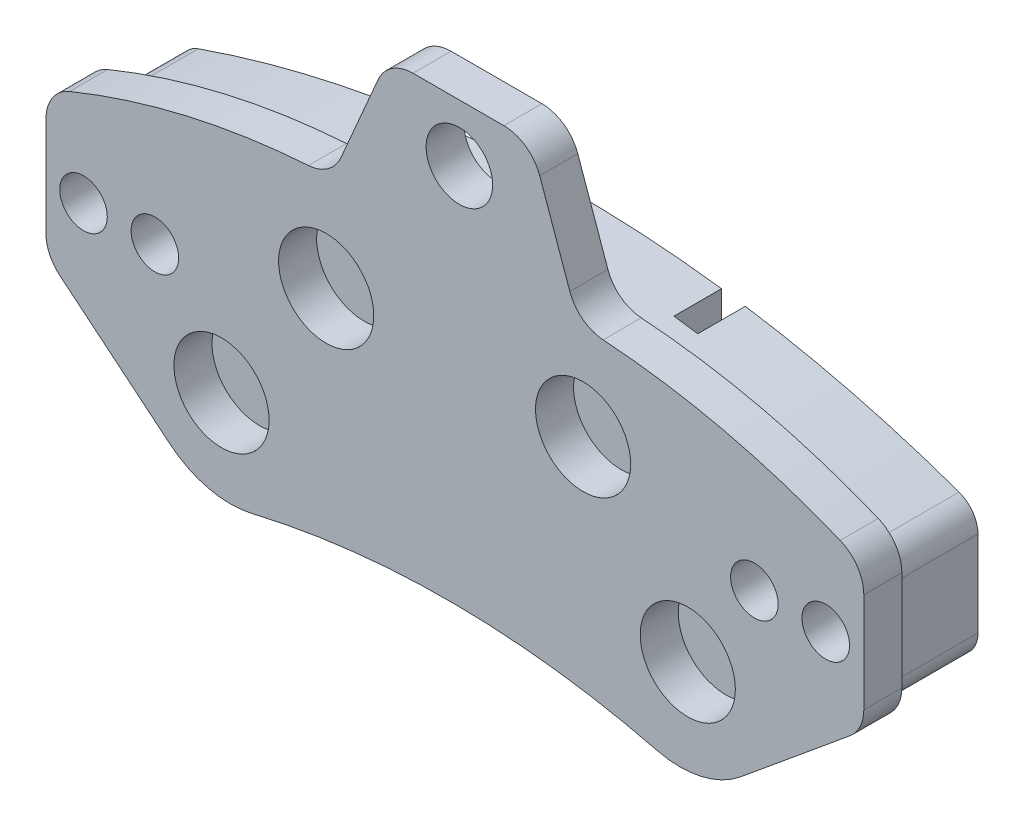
ISO-10303-21;
HEADER;
FILE_DESCRIPTION(('STEP AP214'),'2;1');
FILE_NAME('part.step','',(''),(''),'','','');
FILE_SCHEMA(('AUTOMOTIVE_DESIGN { 1 0 10303 214 1 1 1 1 }'));
ENDSEC;
DATA;
#1=APPLICATION_CONTEXT('core data for automotive mechanical design processes');
#2=APPLICATION_PROTOCOL_DEFINITION('international standard','automotive_design',2000,#1);
#3=PRODUCT_CONTEXT('',#1,'mechanical');
#4=PRODUCT('Part','Part','',(#3));
#5=PRODUCT_RELATED_PRODUCT_CATEGORY('part','',(#4));
#6=PRODUCT_DEFINITION_FORMATION('','',#4);
#7=PRODUCT_DEFINITION_CONTEXT('part definition',#1,'design');
#8=PRODUCT_DEFINITION('design','',#6,#7);
#9=PRODUCT_DEFINITION_SHAPE('','',#8);
#10=(LENGTH_UNIT() NAMED_UNIT(*) SI_UNIT(.MILLI.,.METRE.));
#11=(NAMED_UNIT(*) PLANE_ANGLE_UNIT() SI_UNIT($,.RADIAN.));
#12=(NAMED_UNIT(*) SI_UNIT($,.STERADIAN.) SOLID_ANGLE_UNIT());
#13=UNCERTAINTY_MEASURE_WITH_UNIT(LENGTH_MEASURE(1.E-05),#10,'distance_accuracy_value','');
#14=(GEOMETRIC_REPRESENTATION_CONTEXT(3) GLOBAL_UNCERTAINTY_ASSIGNED_CONTEXT((#13)) GLOBAL_UNIT_ASSIGNED_CONTEXT((#10,
#11,#12)) REPRESENTATION_CONTEXT('',''));
#15=CARTESIAN_POINT('',(0.,0.,0.));
#16=DIRECTION('',(0.,0.,1.));
#17=DIRECTION('',(1.,0.,0.));
#18=AXIS2_PLACEMENT_3D('',#15,#16,#17);
#19=CARTESIAN_POINT('',(-39.4411254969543,31.112345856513,-13.));
#20=DIRECTION('',(0.,0.,-1.));
#21=DIRECTION('',(-1.,0.,0.));
#22=AXIS2_PLACEMENT_3D('',#19,#20,#21);
#23=PLANE('',#22);
#24=DIRECTION('',(0.,-1.,0.));
#25=VECTOR('',#24,1.);
#26=CARTESIAN_POINT('',(17.0485325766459,9.19720404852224,-13.));
#27=LINE('',#26,#25);
#28=CARTESIAN_POINT('',(17.0485325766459,39.2463066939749,-13.));
#29=VERTEX_POINT('',#28);
#30=CARTESIAN_POINT('',(17.0485325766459,9.19720404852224,-13.));
#31=VERTEX_POINT('',#30);
#32=EDGE_CURVE('E292',#29,#31,#27,.T.);
#33=ORIENTED_EDGE('',*,*,#32,.F.);
#34=CARTESIAN_POINT('',(-0.992651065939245,-79.3897573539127,-13.));
#35=DIRECTION('',(0.,0.,-1.));
#36=DIRECTION('',(1.,0.,0.));
#37=AXIS2_PLACEMENT_3D('',#34,#35,#36);
#38=CIRCLE('',#37,120.);
#39=CARTESIAN_POINT('',(39.5126320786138,33.5674116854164,-13.));
#40=VERTEX_POINT('',#39);
#41=EDGE_CURVE('E307',#29,#40,#38,.T.);
#42=ORIENTED_EDGE('',*,*,#41,.T.);
#43=CARTESIAN_POINT('',(38.5,30.7434824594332,-13.));
#44=DIRECTION('',(0.,0.,-1.));
#45=DIRECTION('',(1.,0.,0.));
#46=AXIS2_PLACEMENT_3D('',#43,#44,#45);
#47=CIRCLE('',#46,2.99999999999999);
#48=CARTESIAN_POINT('',(41.5,30.7434824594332,-13.));
#49=VERTEX_POINT('',#48);
#50=EDGE_CURVE('E310',#40,#49,#47,.T.);
#51=ORIENTED_EDGE('',*,*,#50,.T.);
#52=DIRECTION('',(0.,-1.,0.));
#53=VECTOR('',#52,1.);
#54=CARTESIAN_POINT('',(41.5,30.7434824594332,-13.));
#55=LINE('',#54,#53);
#56=CARTESIAN_POINT('',(41.5,21.7434824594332,-13.));
#57=VERTEX_POINT('',#56);
#58=EDGE_CURVE('E316',#49,#57,#55,.T.);
#59=ORIENTED_EDGE('',*,*,#58,.T.);
#60=CARTESIAN_POINT('',(38.5,21.7434824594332,-13.));
#61=DIRECTION('',(0.,0.,-1.));
#62=DIRECTION('',(-1.,0.,0.));
#63=AXIS2_PLACEMENT_3D('',#60,#61,#62);
#64=CIRCLE('',#63,3.);
#65=CARTESIAN_POINT('',(40.4090909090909,19.4293148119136,-13.));
#66=VERTEX_POINT('',#65);
#67=EDGE_CURVE('E318',#57,#66,#64,.T.);
#68=ORIENTED_EDGE('',*,*,#67,.T.);
#69=DIRECTION('',(-0.77138921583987,-0.636363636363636,0.));
#70=VECTOR('',#69,1.);
#71=CARTESIAN_POINT('',(40.4090909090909,19.4293148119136,-13.));
#72=LINE('',#71,#70);
#73=CARTESIAN_POINT('',(29.4269884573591,10.3695425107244,-13.));
#74=VERTEX_POINT('',#73);
#75=EDGE_CURVE('E320',#66,#74,#72,.T.);
#76=ORIENTED_EDGE('',*,*,#75,.T.);
#77=CARTESIAN_POINT('',(23.0633520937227,18.0834346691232,-13.));
#78=DIRECTION('',(0.,0.,-1.));
#79=DIRECTION('',(1.,0.,0.));
#80=AXIS2_PLACEMENT_3D('',#77,#78,#79);
#81=CIRCLE('',#80,10.);
#82=CARTESIAN_POINT('',(20.6485325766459,8.37938156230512,-13.));
#83=VERTEX_POINT('',#82);
#84=EDGE_CURVE('E322',#74,#83,#81,.T.);
#85=ORIENTED_EDGE('',*,*,#84,.T.);
#86=CARTESIAN_POINT('',(-1.08484307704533,-78.9570963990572,-13.));
#87=DIRECTION('',(0.,0.,1.));
#88=DIRECTION('',(-1.,0.,0.));
#89=AXIS2_PLACEMENT_3D('',#86,#87,#88);
#90=CIRCLE('',#89,90.);
#91=EDGE_CURVE('E325',#83,#31,#90,.T.);
#92=ORIENTED_EDGE('',*,*,#91,.T.);
#93=EDGE_LOOP('',(#33,#42,#51,#59,#68,#76,#85,#92));
#94=FACE_BOUND('',#93,.T.);
#95=ADVANCED_FACE('F28',(#94),#23,.T.);
#96=DIRECTION('',(0.,1.,0.));
#97=VECTOR('',#96,1.);
#98=CARTESIAN_POINT('',(-18.0519173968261,39.3914761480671,-13.));
#99=LINE('',#98,#97);
#100=CARTESIAN_POINT('',(-18.0519173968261,9.42909250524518,-13.));
#101=VERTEX_POINT('',#100);
#102=CARTESIAN_POINT('',(-18.0519173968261,39.3914761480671,-13.));
#103=VERTEX_POINT('',#102);
#104=EDGE_CURVE('E1218',#101,#103,#99,.T.);
#105=ORIENTED_EDGE('',*,*,#104,.F.);
#106=CARTESIAN_POINT('',(-21.6519173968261,8.66136885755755,-13.));
#107=VERTEX_POINT('',#106);
#108=EDGE_CURVE('E324',#101,#107,#90,.T.);
#109=ORIENTED_EDGE('',*,*,#108,.T.);
#110=CARTESIAN_POINT('',(-23.9371478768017,18.3967538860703,-13.));
#111=DIRECTION('',(0.,0.,-1.));
#112=DIRECTION('',(-1.,0.,0.));
#113=AXIS2_PLACEMENT_3D('',#110,#111,#112);
#114=CIRCLE('',#113,10.);
#115=CARTESIAN_POINT('',(-30.3007842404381,10.6828617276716,-13.));
#116=VERTEX_POINT('',#115);
#117=EDGE_CURVE('E328',#107,#116,#114,.T.);
#118=ORIENTED_EDGE('',*,*,#117,.T.);
#119=DIRECTION('',(-0.77138921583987,0.636363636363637,0.));
#120=VECTOR('',#119,1.);
#121=CARTESIAN_POINT('',(-41.3502164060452,19.7981782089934,-13.));
#122=LINE('',#121,#120);
#123=CARTESIAN_POINT('',(-41.3502164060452,19.7981782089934,-13.));
#124=VERTEX_POINT('',#123);
#125=EDGE_CURVE('E331',#116,#124,#122,.T.);
#126=ORIENTED_EDGE('',*,*,#125,.T.);
#127=CARTESIAN_POINT('',(-39.4411254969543,22.112345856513,-13.));
#128=DIRECTION('',(0.,0.,-1.));
#129=DIRECTION('',(1.,0.,0.));
#130=AXIS2_PLACEMENT_3D('',#127,#128,#129);
#131=CIRCLE('',#130,3.);
#132=CARTESIAN_POINT('',(-42.4411254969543,22.112345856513,-13.));
#133=VERTEX_POINT('',#132);
#134=EDGE_CURVE('E333',#124,#133,#131,.T.);
#135=ORIENTED_EDGE('',*,*,#134,.T.);
#136=DIRECTION('',(0.,1.,0.));
#137=VECTOR('',#136,1.);
#138=CARTESIAN_POINT('',(-42.4411254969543,31.112345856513,-13.));
#139=LINE('',#138,#137);
#140=CARTESIAN_POINT('',(-42.4411254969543,31.112345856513,-13.));
#141=VERTEX_POINT('',#140);
#142=EDGE_CURVE('E335',#133,#141,#139,.T.);
#143=ORIENTED_EDGE('',*,*,#142,.T.);
#144=CARTESIAN_POINT('',(-39.4411254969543,31.112345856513,-13.));
#145=DIRECTION('',(0.,0.,-1.));
#146=DIRECTION('',(-1.,0.,0.));
#147=AXIS2_PLACEMENT_3D('',#144,#145,#146);
#148=CIRCLE('',#147,3.);
#149=CARTESIAN_POINT('',(-40.4269838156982,33.9457331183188,-13.));
#150=VERTEX_POINT('',#149);
#151=EDGE_CURVE('E311',#141,#150,#148,.T.);
#152=ORIENTED_EDGE('',*,*,#151,.T.);
#153=EDGE_CURVE('E306',#150,#103,#38,.T.);
#154=ORIENTED_EDGE('',*,*,#153,.T.);
#155=EDGE_LOOP('',(#105,#109,#118,#126,#135,#143,#152,#154));
#156=FACE_BOUND('',#155,.T.);
#157=ADVANCED_FACE('F671',(#156),#23,.T.);
#158=CARTESIAN_POINT('',(38.5,32.2243387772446,-4.));
#159=DIRECTION('',(0.,0.,-1.));
#160=DIRECTION('',(-1.,0.,0.));
#161=AXIS2_PLACEMENT_3D('',#158,#159,#160);
#162=PLANE('',#161);
#163=CARTESIAN_POINT('',(38.5,32.2243387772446,-4.));
#164=DIRECTION('',(0.,0.,1.));
#165=DIRECTION('',(-1.,0.,0.));
#166=AXIS2_PLACEMENT_3D('',#163,#164,#165);
#167=CIRCLE('',#166,3.99999999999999);
#168=CARTESIAN_POINT('',(42.5,32.2243387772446,-4.));
#169=VERTEX_POINT('',#168);
#170=CARTESIAN_POINT('',(40.017802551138,35.9251867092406,-4.));
#171=VERTEX_POINT('',#170);
#172=EDGE_CURVE('E485',#169,#171,#167,.T.);
#173=ORIENTED_EDGE('',*,*,#172,.F.);
#174=DIRECTION('',(0.,1.,0.));
#175=VECTOR('',#174,1.);
#176=CARTESIAN_POINT('',(42.5,32.2243387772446,-4.));
#177=LINE('',#176,#175);
#178=CARTESIAN_POINT('',(42.5,21.7434824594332,-4.));
#179=VERTEX_POINT('',#178);
#180=EDGE_CURVE('E542',#179,#169,#177,.T.);
#181=ORIENTED_EDGE('',*,*,#180,.F.);
#182=CARTESIAN_POINT('',(38.5,21.7434824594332,-4.));
#183=DIRECTION('',(0.,0.,1.));
#184=DIRECTION('',(-1.,0.,0.));
#185=AXIS2_PLACEMENT_3D('',#182,#183,#184);
#186=CIRCLE('',#185,4.00000000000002);
#187=CARTESIAN_POINT('',(41.0454545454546,18.6579255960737,-4.));
#188=VERTEX_POINT('',#187);
#189=EDGE_CURVE('E539',#188,#179,#186,.T.);
#190=ORIENTED_EDGE('',*,*,#189,.F.);
#191=DIRECTION('',(0.77138921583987,0.636363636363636,0.));
#192=VECTOR('',#191,1.);
#193=CARTESIAN_POINT('',(41.0454545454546,18.6579255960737,-4.));
#194=LINE('',#193,#192);
#195=CARTESIAN_POINT('',(29.5537999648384,9.17779423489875,-4.));
#196=VERTEX_POINT('',#195);
#197=EDGE_CURVE('E536',#196,#188,#194,.T.);
#198=ORIENTED_EDGE('',*,*,#197,.F.);
#199=CARTESIAN_POINT('',(23.190163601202,16.8916863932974,-4.));
#200=DIRECTION('',(0.,0.,1.));
#201=DIRECTION('',(-1.,0.,0.));
#202=AXIS2_PLACEMENT_3D('',#199,#200,#201);
#203=CIRCLE('',#202,9.99999999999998);
#204=CARTESIAN_POINT('',(20.7629729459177,7.19072017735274,-4.));
#205=VERTEX_POINT('',#204);
#206=EDGE_CURVE('E533',#205,#196,#203,.T.);
#207=ORIENTED_EDGE('',*,*,#206,.F.);
#208=CARTESIAN_POINT('',(-1.08174295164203,-80.1179757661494,-4.));
#209=DIRECTION('',(0.,0.,-1.));
#210=DIRECTION('',(1.,0.,0.));
#211=AXIS2_PLACEMENT_3D('',#208,#209,#210);
#212=CIRCLE('',#211,90.);
#213=CARTESIAN_POINT('',(-21.7659775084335,7.47290527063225,-4.));
#214=VERTEX_POINT('',#213);
#215=EDGE_CURVE('E530',#214,#205,#212,.T.);
#216=ORIENTED_EDGE('',*,*,#215,.F.);
#217=CARTESIAN_POINT('',(-24.0642257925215,17.2052253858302,-4.));
#218=DIRECTION('',(0.,0.,1.));
#219=DIRECTION('',(-1.,0.,0.));
#220=AXIS2_PLACEMENT_3D('',#217,#218,#219);
#221=CIRCLE('',#220,10.);
#222=CARTESIAN_POINT('',(-30.4278621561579,9.49133322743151,-4.));
#223=VERTEX_POINT('',#222);
#224=EDGE_CURVE('E527',#223,#214,#221,.T.);
#225=ORIENTED_EDGE('',*,*,#224,.F.);
#226=DIRECTION('',(0.77138921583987,-0.636363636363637,0.));
#227=VECTOR('',#226,1.);
#228=CARTESIAN_POINT('',(-30.4278621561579,9.49133322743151,-4.));
#229=LINE('',#228,#227);
#230=CARTESIAN_POINT('',(-41.9865800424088,19.0267889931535,-4.));
#231=VERTEX_POINT('',#230);
#232=EDGE_CURVE('E524',#231,#223,#229,.T.);
#233=ORIENTED_EDGE('',*,*,#232,.F.);
#234=CARTESIAN_POINT('',(-39.4411254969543,22.112345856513,-4.));
#235=DIRECTION('',(0.,0.,1.));
#236=DIRECTION('',(-1.,0.,0.));
#237=AXIS2_PLACEMENT_3D('',#234,#235,#236);
#238=CIRCLE('',#237,4.);
#239=CARTESIAN_POINT('',(-43.4411254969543,22.112345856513,-4.));
#240=VERTEX_POINT('',#239);
#241=EDGE_CURVE('E521',#240,#231,#238,.T.);
#242=ORIENTED_EDGE('',*,*,#241,.F.);
#243=DIRECTION('',(0.,-1.,0.));
#244=VECTOR('',#243,1.);
#245=CARTESIAN_POINT('',(-43.4411254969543,22.112345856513,-4.));
#246=LINE('',#245,#244);
#247=CARTESIAN_POINT('',(-43.4411254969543,32.5932021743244,-4.));
#248=VERTEX_POINT('',#247);
#249=EDGE_CURVE('E518',#248,#240,#246,.T.);
#250=ORIENTED_EDGE('',*,*,#249,.F.);
#251=CARTESIAN_POINT('',(-39.4411254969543,32.5932021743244,-4.));
#252=DIRECTION('',(0.,0.,1.));
#253=DIRECTION('',(-1.,0.,0.));
#254=AXIS2_PLACEMENT_3D('',#251,#252,#253);
#255=CIRCLE('',#254,3.99999999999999);
#256=CARTESIAN_POINT('',(-40.9589280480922,36.2940501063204,-4.));
#257=VERTEX_POINT('',#256);
#258=EDGE_CURVE('E515',#257,#248,#255,.T.);
#259=ORIENTED_EDGE('',*,*,#258,.F.);
#260=CARTESIAN_POINT('',(-10.6028770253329,-37.7229085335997,-4.));
#261=DIRECTION('',(0.,0.,1.));
#262=DIRECTION('',(-1.,0.,0.));
#263=AXIS2_PLACEMENT_3D('',#260,#261,#262);
#264=CIRCLE('',#263,80.);
#265=CARTESIAN_POINT('',(-15.8656069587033,42.1038017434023,-4.));
#266=VERTEX_POINT('',#265);
#267=EDGE_CURVE('E512',#266,#257,#264,.T.);
#268=ORIENTED_EDGE('',*,*,#267,.F.);
#269=CARTESIAN_POINT('',(-16.1287434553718,46.0951372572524,-4.));
#270=DIRECTION('',(0.,0.,-1.));
#271=DIRECTION('',(-1.,0.,0.));
#272=AXIS2_PLACEMENT_3D('',#269,#270,#271);
#273=CIRCLE('',#272,4.);
#274=CARTESIAN_POINT('',(-12.4558708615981,44.5108371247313,-4.));
#275=VERTEX_POINT('',#274);
#276=EDGE_CURVE('E509',#275,#266,#273,.T.);
#277=ORIENTED_EDGE('',*,*,#276,.F.);
#278=DIRECTION('',(-0.396075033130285,-0.91821814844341,0.));
#279=VECTOR('',#278,1.);
#280=CARTESIAN_POINT('',(-8.54201643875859,53.5843001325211,-4.));
#281=LINE('',#280,#279);
#282=CARTESIAN_POINT('',(-8.54201643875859,53.5843001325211,-4.));
#283=VERTEX_POINT('',#282);
#284=EDGE_CURVE('E506',#283,#275,#281,.T.);
#285=ORIENTED_EDGE('',*,*,#284,.F.);
#286=CARTESIAN_POINT('',(-4.86914384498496,52.,-4.));
#287=DIRECTION('',(0.,0.,1.));
#288=DIRECTION('',(1.,0.,0.));
#289=AXIS2_PLACEMENT_3D('',#286,#287,#288);
#290=CIRCLE('',#289,4.);
#291=CARTESIAN_POINT('',(-4.86914384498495,56.,-4.));
#292=VERTEX_POINT('',#291);
#293=EDGE_CURVE('E503',#292,#283,#290,.T.);
#294=ORIENTED_EDGE('',*,*,#293,.F.);
#295=DIRECTION('',(-1.,0.,0.));
#296=VECTOR('',#295,1.);
#297=CARTESIAN_POINT('',(-4.86914384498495,56.,-4.));
#298=LINE('',#297,#296);
#299=CARTESIAN_POINT('',(4.67157287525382,56.,-4.));
#300=VERTEX_POINT('',#299);
#301=EDGE_CURVE('E500',#300,#292,#298,.T.);
#302=ORIENTED_EDGE('',*,*,#301,.F.);
#303=CARTESIAN_POINT('',(4.6715728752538,52.,-4.));
#304=DIRECTION('',(0.,0.,1.));
#305=DIRECTION('',(-1.,0.,0.));
#306=AXIS2_PLACEMENT_3D('',#303,#304,#305);
#307=CIRCLE('',#306,4.00000000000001);
#308=CARTESIAN_POINT('',(8.44280904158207,53.3333333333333,-4.));
#309=VERTEX_POINT('',#308);
#310=EDGE_CURVE('E497',#309,#300,#307,.T.);
#311=ORIENTED_EDGE('',*,*,#310,.F.);
#312=DIRECTION('',(-0.333333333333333,0.942809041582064,0.));
#313=VECTOR('',#312,1.);
#314=CARTESIAN_POINT('',(8.44280904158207,53.3333333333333,-4.));
#315=LINE('',#314,#313);
#316=CARTESIAN_POINT('',(11.6082657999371,44.3800695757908,-4.));
#317=VERTEX_POINT('',#316);
#318=EDGE_CURVE('E494',#317,#309,#315,.T.);
#319=ORIENTED_EDGE('',*,*,#318,.F.);
#320=CARTESIAN_POINT('',(15.3795019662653,45.7134029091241,-4.));
#321=DIRECTION('',(0.,0.,-1.));
#322=DIRECTION('',(1.,0.,0.));
#323=AXIS2_PLACEMENT_3D('',#320,#321,#322);
#324=CIRCLE('',#323,4.);
#325=CARTESIAN_POINT('',(15.1072281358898,41.7226802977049,-4.));
#326=VERTEX_POINT('',#325);
#327=EDGE_CURVE('E491',#326,#317,#324,.T.);
#328=ORIENTED_EDGE('',*,*,#327,.F.);
#329=CARTESIAN_POINT('',(9.66175152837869,-38.0917719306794,-4.));
#330=DIRECTION('',(0.,0.,1.));
#331=DIRECTION('',(-1.,0.,0.));
#332=AXIS2_PLACEMENT_3D('',#329,#330,#331);
#333=CIRCLE('',#332,80.);
#334=EDGE_CURVE('E488',#171,#326,#333,.T.);
#335=ORIENTED_EDGE('',*,*,#334,.F.);
#336=EDGE_LOOP('',(#173,#181,#190,#198,#207,#216,#225,#233,#242,#250,#259,#268,#277,#285,#294,
#302,#311,#319,#328,#335));
#337=FACE_BOUND('',#336,.T.);
#338=CARTESIAN_POINT('',(0.,50.,-4.));
#339=DIRECTION('',(0.,0.,1.));
#340=DIRECTION('',(1.,0.,0.));
#341=AXIS2_PLACEMENT_3D('',#338,#339,#340);
#342=CIRCLE('',#341,3.5);
#343=CARTESIAN_POINT('',(3.5,50.,-4.));
#344=VERTEX_POINT('',#343);
#345=EDGE_CURVE('E422',#344,#344,#342,.T.);
#346=ORIENTED_EDGE('',*,*,#345,.T.);
#347=EDGE_LOOP('',(#346));
#348=FACE_BOUND('',#347,.T.);
#349=CARTESIAN_POINT('',(-0.992651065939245,-79.3897573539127,-4.));
#350=DIRECTION('',(0.,0.,-1.));
#351=DIRECTION('',(1.,0.,0.));
#352=AXIS2_PLACEMENT_3D('',#349,#350,#351);
#353=CIRCLE('',#352,120.);
#354=CARTESIAN_POINT('',(-40.4269838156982,33.9457331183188,-4.));
#355=VERTEX_POINT('',#354);
#356=CARTESIAN_POINT('',(39.5126320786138,33.5674116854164,-4.));
#357=VERTEX_POINT('',#356);
#358=EDGE_CURVE('E1243',#355,#357,#353,.T.);
#359=ORIENTED_EDGE('',*,*,#358,.F.);
#360=CARTESIAN_POINT('',(-39.4411254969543,31.112345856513,-4.));
#361=DIRECTION('',(0.,0.,-1.));
#362=DIRECTION('',(-1.,0.,0.));
#363=AXIS2_PLACEMENT_3D('',#360,#361,#362);
#364=CIRCLE('',#363,3.);
#365=CARTESIAN_POINT('',(-42.4411254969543,31.112345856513,-4.));
#366=VERTEX_POINT('',#365);
#367=EDGE_CURVE('E1235',#366,#355,#364,.T.);
#368=ORIENTED_EDGE('',*,*,#367,.F.);
#369=DIRECTION('',(0.,1.,0.));
#370=VECTOR('',#369,1.);
#371=CARTESIAN_POINT('',(-42.4411254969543,31.112345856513,-4.));
#372=LINE('',#371,#370);
#373=CARTESIAN_POINT('',(-42.4411254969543,22.112345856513,-4.));
#374=VERTEX_POINT('',#373);
#375=EDGE_CURVE('E1263',#374,#366,#372,.T.);
#376=ORIENTED_EDGE('',*,*,#375,.F.);
#377=CARTESIAN_POINT('',(-39.4411254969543,22.112345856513,-4.));
#378=DIRECTION('',(0.,0.,-1.));
#379=DIRECTION('',(1.,0.,0.));
#380=AXIS2_PLACEMENT_3D('',#377,#378,#379);
#381=CIRCLE('',#380,3.);
#382=CARTESIAN_POINT('',(-41.3502164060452,19.7981782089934,-4.));
#383=VERTEX_POINT('',#382);
#384=EDGE_CURVE('E1261',#383,#374,#381,.T.);
#385=ORIENTED_EDGE('',*,*,#384,.F.);
#386=DIRECTION('',(-0.77138921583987,0.636363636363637,0.));
#387=VECTOR('',#386,1.);
#388=CARTESIAN_POINT('',(-41.3502164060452,19.7981782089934,-4.));
#389=LINE('',#388,#387);
#390=CARTESIAN_POINT('',(-30.3007842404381,10.6828617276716,-4.));
#391=VERTEX_POINT('',#390);
#392=EDGE_CURVE('E1259',#391,#383,#389,.T.);
#393=ORIENTED_EDGE('',*,*,#392,.F.);
#394=CARTESIAN_POINT('',(-23.9371478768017,18.3967538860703,-4.));
#395=DIRECTION('',(0.,0.,-1.));
#396=DIRECTION('',(-1.,0.,0.));
#397=AXIS2_PLACEMENT_3D('',#394,#395,#396);
#398=CIRCLE('',#397,10.);
#399=CARTESIAN_POINT('',(-21.6519173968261,8.66136885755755,-4.));
#400=VERTEX_POINT('',#399);
#401=EDGE_CURVE('E1257',#400,#391,#398,.T.);
#402=ORIENTED_EDGE('',*,*,#401,.F.);
#403=CARTESIAN_POINT('',(-1.08484307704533,-78.9570963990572,-4.));
#404=DIRECTION('',(0.,0.,1.));
#405=DIRECTION('',(-1.,0.,0.));
#406=AXIS2_PLACEMENT_3D('',#403,#404,#405);
#407=CIRCLE('',#406,90.);
#408=CARTESIAN_POINT('',(20.6485325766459,8.37938156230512,-4.));
#409=VERTEX_POINT('',#408);
#410=EDGE_CURVE('E1255',#409,#400,#407,.T.);
#411=ORIENTED_EDGE('',*,*,#410,.F.);
#412=CARTESIAN_POINT('',(23.0633520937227,18.0834346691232,-4.));
#413=DIRECTION('',(0.,0.,-1.));
#414=DIRECTION('',(1.,0.,0.));
#415=AXIS2_PLACEMENT_3D('',#412,#413,#414);
#416=CIRCLE('',#415,10.);
#417=CARTESIAN_POINT('',(29.4269884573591,10.3695425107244,-4.));
#418=VERTEX_POINT('',#417);
#419=EDGE_CURVE('E1253',#418,#409,#416,.T.);
#420=ORIENTED_EDGE('',*,*,#419,.F.);
#421=DIRECTION('',(-0.77138921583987,-0.636363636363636,0.));
#422=VECTOR('',#421,1.);
#423=CARTESIAN_POINT('',(40.4090909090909,19.4293148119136,-4.));
#424=LINE('',#423,#422);
#425=CARTESIAN_POINT('',(40.4090909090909,19.4293148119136,-4.));
#426=VERTEX_POINT('',#425);
#427=EDGE_CURVE('E1251',#426,#418,#424,.T.);
#428=ORIENTED_EDGE('',*,*,#427,.F.);
#429=CARTESIAN_POINT('',(38.5,21.7434824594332,-4.));
#430=DIRECTION('',(0.,0.,-1.));
#431=DIRECTION('',(-1.,0.,0.));
#432=AXIS2_PLACEMENT_3D('',#429,#430,#431);
#433=CIRCLE('',#432,3.);
#434=CARTESIAN_POINT('',(41.5,21.7434824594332,-4.));
#435=VERTEX_POINT('',#434);
#436=EDGE_CURVE('E1249',#435,#426,#433,.T.);
#437=ORIENTED_EDGE('',*,*,#436,.F.);
#438=DIRECTION('',(0.,-1.,0.));
#439=VECTOR('',#438,1.);
#440=CARTESIAN_POINT('',(41.5,30.7434824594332,-4.));
#441=LINE('',#440,#439);
#442=CARTESIAN_POINT('',(41.5,30.7434824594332,-4.));
#443=VERTEX_POINT('',#442);
#444=EDGE_CURVE('E1247',#443,#435,#441,.T.);
#445=ORIENTED_EDGE('',*,*,#444,.F.);
#446=CARTESIAN_POINT('',(38.5,30.7434824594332,-4.));
#447=DIRECTION('',(0.,0.,-1.));
#448=DIRECTION('',(1.,0.,0.));
#449=AXIS2_PLACEMENT_3D('',#446,#447,#448);
#450=CIRCLE('',#449,2.99999999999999);
#451=EDGE_CURVE('E1245',#357,#443,#450,.T.);
#452=ORIENTED_EDGE('',*,*,#451,.F.);
#453=EDGE_LOOP('',(#359,#368,#376,#385,#393,#402,#411,#420,#428,#437,#445,#452));
#454=FACE_BOUND('',#453,.T.);
#455=ADVANCED_FACE('F594',(#337,#348,#454),#162,.T.);
#456=CARTESIAN_POINT('',(38.5,32.2243387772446,-4.));
#457=DIRECTION('',(0.,0.,1.));
#458=DIRECTION('',(1.,0.,0.));
#459=AXIS2_PLACEMENT_3D('',#456,#457,#458);
#460=CYLINDRICAL_SURFACE('',#459,3.99999999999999);
#461=CARTESIAN_POINT('',(38.5,32.2243387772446,0.));
#462=DIRECTION('',(0.,0.,1.));
#463=DIRECTION('',(-1.,0.,0.));
#464=AXIS2_PLACEMENT_3D('',#461,#462,#463);
#465=CIRCLE('',#464,3.99999999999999);
#466=CARTESIAN_POINT('',(42.5,32.2243387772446,0.));
#467=VERTEX_POINT('',#466);
#468=CARTESIAN_POINT('',(40.017802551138,35.9251867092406,0.));
#469=VERTEX_POINT('',#468);
#470=EDGE_CURVE('E425',#467,#469,#465,.T.);
#471=ORIENTED_EDGE('',*,*,#470,.F.);
#472=DIRECTION('',(0.,0.,1.));
#473=VECTOR('',#472,1.);
#474=CARTESIAN_POINT('',(42.5,32.2243387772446,-4.));
#475=LINE('',#474,#473);
#476=EDGE_CURVE('E11',#169,#467,#475,.T.);
#477=ORIENTED_EDGE('',*,*,#476,.F.);
#478=ORIENTED_EDGE('',*,*,#172,.T.);
#479=DIRECTION('',(0.,0.,1.));
#480=VECTOR('',#479,1.);
#481=CARTESIAN_POINT('',(40.017802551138,35.9251867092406,-4.));
#482=LINE('',#481,#480);
#483=EDGE_CURVE('E32',#171,#469,#482,.T.);
#484=ORIENTED_EDGE('',*,*,#483,.T.);
#485=EDGE_LOOP('',(#471,#477,#478,#484));
#486=FACE_BOUND('',#485,.T.);
#487=ADVANCED_FACE('F30',(#486),#460,.T.);
#488=CARTESIAN_POINT('',(42.5,32.2243387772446,-4.));
#489=DIRECTION('',(1.,0.,0.));
#490=DIRECTION('',(0.,1.,0.));
#491=AXIS2_PLACEMENT_3D('',#488,#489,#490);
#492=PLANE('',#491);
#493=DIRECTION('',(0.,1.,0.));
#494=VECTOR('',#493,1.);
#495=CARTESIAN_POINT('',(42.5,32.2243387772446,0.));
#496=LINE('',#495,#494);
#497=CARTESIAN_POINT('',(42.5,21.7434824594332,0.));
#498=VERTEX_POINT('',#497);
#499=EDGE_CURVE('E482',#498,#467,#496,.T.);
#500=ORIENTED_EDGE('',*,*,#499,.F.);
#501=DIRECTION('',(0.,0.,1.));
#502=VECTOR('',#501,1.);
#503=CARTESIAN_POINT('',(42.5,21.7434824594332,-4.));
#504=LINE('',#503,#502);
#505=EDGE_CURVE('E37',#179,#498,#504,.T.);
#506=ORIENTED_EDGE('',*,*,#505,.F.);
#507=ORIENTED_EDGE('',*,*,#180,.T.);
#508=ORIENTED_EDGE('',*,*,#476,.T.);
#509=EDGE_LOOP('',(#500,#506,#507,#508));
#510=FACE_BOUND('',#509,.T.);
#511=ADVANCED_FACE('F591',(#510),#492,.T.);
#512=CARTESIAN_POINT('',(38.5,21.7434824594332,-4.));
#513=DIRECTION('',(0.,0.,1.));
#514=DIRECTION('',(1.,0.,0.));
#515=AXIS2_PLACEMENT_3D('',#512,#513,#514);
#516=CYLINDRICAL_SURFACE('',#515,4.00000000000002);
#517=CARTESIAN_POINT('',(38.5,21.7434824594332,0.));
#518=DIRECTION('',(0.,0.,1.));
#519=DIRECTION('',(-1.,0.,0.));
#520=AXIS2_PLACEMENT_3D('',#517,#518,#519);
#521=CIRCLE('',#520,4.00000000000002);
#522=CARTESIAN_POINT('',(41.0454545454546,18.6579255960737,0.));
#523=VERTEX_POINT('',#522);
#524=EDGE_CURVE('E479',#523,#498,#521,.T.);
#525=ORIENTED_EDGE('',*,*,#524,.F.);
#526=DIRECTION('',(0.,0.,1.));
#527=VECTOR('',#526,1.);
#528=CARTESIAN_POINT('',(41.0454545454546,18.6579255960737,-4.));
#529=LINE('',#528,#527);
#530=EDGE_CURVE('E546',#188,#523,#529,.T.);
#531=ORIENTED_EDGE('',*,*,#530,.F.);
#532=ORIENTED_EDGE('',*,*,#189,.T.);
#533=ORIENTED_EDGE('',*,*,#505,.T.);
#534=EDGE_LOOP('',(#525,#531,#532,#533));
#535=FACE_BOUND('',#534,.T.);
#536=ADVANCED_FACE('F661',(#535),#516,.T.);
#537=CARTESIAN_POINT('',(41.0454545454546,18.6579255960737,-4.));
#538=DIRECTION('',(0.636363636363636,-0.77138921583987,0.));
#539=DIRECTION('',(0.77138921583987,0.636363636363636,0.));
#540=AXIS2_PLACEMENT_3D('',#537,#538,#539);
#541=PLANE('',#540);
#542=DIRECTION('',(0.77138921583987,0.636363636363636,0.));
#543=VECTOR('',#542,1.);
#544=CARTESIAN_POINT('',(41.0454545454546,18.6579255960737,0.));
#545=LINE('',#544,#543);
#546=CARTESIAN_POINT('',(29.5537999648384,9.17779423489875,0.));
#547=VERTEX_POINT('',#546);
#548=EDGE_CURVE('E476',#547,#523,#545,.T.);
#549=ORIENTED_EDGE('',*,*,#548,.F.);
#550=DIRECTION('',(0.,0.,1.));
#551=VECTOR('',#550,1.);
#552=CARTESIAN_POINT('',(29.5537999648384,9.17779423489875,-4.));
#553=LINE('',#552,#551);
#554=EDGE_CURVE('E548',#196,#547,#553,.T.);
#555=ORIENTED_EDGE('',*,*,#554,.F.);
#556=ORIENTED_EDGE('',*,*,#197,.T.);
#557=ORIENTED_EDGE('',*,*,#530,.T.);
#558=EDGE_LOOP('',(#549,#555,#556,#557));
#559=FACE_BOUND('',#558,.T.);
#560=ADVANCED_FACE('F659',(#559),#541,.T.);
#561=CARTESIAN_POINT('',(23.190163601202,16.8916863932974,-4.));
#562=DIRECTION('',(0.,0.,1.));
#563=DIRECTION('',(1.,0.,0.));
#564=AXIS2_PLACEMENT_3D('',#561,#562,#563);
#565=CYLINDRICAL_SURFACE('',#564,9.99999999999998);
#566=CARTESIAN_POINT('',(23.190163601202,16.8916863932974,0.));
#567=DIRECTION('',(0.,0.,1.));
#568=DIRECTION('',(-1.,0.,0.));
#569=AXIS2_PLACEMENT_3D('',#566,#567,#568);
#570=CIRCLE('',#569,9.99999999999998);
#571=CARTESIAN_POINT('',(20.7629729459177,7.19072017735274,0.));
#572=VERTEX_POINT('',#571);
#573=EDGE_CURVE('E473',#572,#547,#570,.T.);
#574=ORIENTED_EDGE('',*,*,#573,.F.);
#575=DIRECTION('',(0.,0.,1.));
#576=VECTOR('',#575,1.);
#577=CARTESIAN_POINT('',(20.7629729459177,7.19072017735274,-4.));
#578=LINE('',#577,#576);
#579=EDGE_CURVE('E550',#205,#572,#578,.T.);
#580=ORIENTED_EDGE('',*,*,#579,.F.);
#581=ORIENTED_EDGE('',*,*,#206,.T.);
#582=ORIENTED_EDGE('',*,*,#554,.T.);
#583=EDGE_LOOP('',(#574,#580,#581,#582));
#584=FACE_BOUND('',#583,.T.);
#585=ADVANCED_FACE('F655',(#584),#565,.T.);
#586=CARTESIAN_POINT('',(-1.08174295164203,-80.1179757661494,-4.));
#587=DIRECTION('',(0.,0.,1.));
#588=DIRECTION('',(1.,0.,0.));
#589=AXIS2_PLACEMENT_3D('',#586,#587,#588);
#590=CYLINDRICAL_SURFACE('',#589,90.);
#591=CARTESIAN_POINT('',(-1.08174295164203,-80.1179757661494,0.));
#592=DIRECTION('',(0.,0.,-1.));
#593=DIRECTION('',(1.,0.,0.));
#594=AXIS2_PLACEMENT_3D('',#591,#592,#593);
#595=CIRCLE('',#594,90.);
#596=CARTESIAN_POINT('',(-21.7659775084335,7.47290527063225,0.));
#597=VERTEX_POINT('',#596);
#598=EDGE_CURVE('E470',#597,#572,#595,.T.);
#599=ORIENTED_EDGE('',*,*,#598,.F.);
#600=DIRECTION('',(0.,0.,1.));
#601=VECTOR('',#600,1.);
#602=CARTESIAN_POINT('',(-21.7659775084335,7.47290527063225,-4.));
#603=LINE('',#602,#601);
#604=EDGE_CURVE('E552',#214,#597,#603,.T.);
#605=ORIENTED_EDGE('',*,*,#604,.F.);
#606=ORIENTED_EDGE('',*,*,#215,.T.);
#607=ORIENTED_EDGE('',*,*,#579,.T.);
#608=EDGE_LOOP('',(#599,#605,#606,#607));
#609=FACE_BOUND('',#608,.T.);
#610=ADVANCED_FACE('F651',(#609),#590,.F.);
#611=CARTESIAN_POINT('',(-24.0642257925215,17.2052253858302,-4.));
#612=DIRECTION('',(0.,0.,1.));
#613=DIRECTION('',(1.,0.,0.));
#614=AXIS2_PLACEMENT_3D('',#611,#612,#613);
#615=CYLINDRICAL_SURFACE('',#614,10.);
#616=CARTESIAN_POINT('',(-24.0642257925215,17.2052253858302,0.));
#617=DIRECTION('',(0.,0.,1.));
#618=DIRECTION('',(-1.,0.,0.));
#619=AXIS2_PLACEMENT_3D('',#616,#617,#618);
#620=CIRCLE('',#619,10.);
#621=CARTESIAN_POINT('',(-30.4278621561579,9.49133322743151,0.));
#622=VERTEX_POINT('',#621);
#623=EDGE_CURVE('E467',#622,#597,#620,.T.);
#624=ORIENTED_EDGE('',*,*,#623,.F.);
#625=DIRECTION('',(0.,0.,1.));
#626=VECTOR('',#625,1.);
#627=CARTESIAN_POINT('',(-30.4278621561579,9.49133322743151,-4.));
#628=LINE('',#627,#626);
#629=EDGE_CURVE('E554',#223,#622,#628,.T.);
#630=ORIENTED_EDGE('',*,*,#629,.F.);
#631=ORIENTED_EDGE('',*,*,#224,.T.);
#632=ORIENTED_EDGE('',*,*,#604,.T.);
#633=EDGE_LOOP('',(#624,#630,#631,#632));
#634=FACE_BOUND('',#633,.T.);
#635=ADVANCED_FACE('F647',(#634),#615,.T.);
#636=CARTESIAN_POINT('',(-30.4278621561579,9.49133322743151,-4.));
#637=DIRECTION('',(-0.636363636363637,-0.77138921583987,0.));
#638=DIRECTION('',(0.77138921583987,-0.636363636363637,0.));
#639=AXIS2_PLACEMENT_3D('',#636,#637,#638);
#640=PLANE('',#639);
#641=DIRECTION('',(0.77138921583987,-0.636363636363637,0.));
#642=VECTOR('',#641,1.);
#643=CARTESIAN_POINT('',(-30.4278621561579,9.49133322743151,0.));
#644=LINE('',#643,#642);
#645=CARTESIAN_POINT('',(-41.9865800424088,19.0267889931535,0.));
#646=VERTEX_POINT('',#645);
#647=EDGE_CURVE('E464',#646,#622,#644,.T.);
#648=ORIENTED_EDGE('',*,*,#647,.F.);
#649=DIRECTION('',(0.,0.,1.));
#650=VECTOR('',#649,1.);
#651=CARTESIAN_POINT('',(-41.9865800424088,19.0267889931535,-4.));
#652=LINE('',#651,#650);
#653=EDGE_CURVE('E556',#231,#646,#652,.T.);
#654=ORIENTED_EDGE('',*,*,#653,.F.);
#655=ORIENTED_EDGE('',*,*,#232,.T.);
#656=ORIENTED_EDGE('',*,*,#629,.T.);
#657=EDGE_LOOP('',(#648,#654,#655,#656));
#658=FACE_BOUND('',#657,.T.);
#659=ADVANCED_FACE('F643',(#658),#640,.T.);
#660=CARTESIAN_POINT('',(-39.4411254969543,22.112345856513,-4.));
#661=DIRECTION('',(0.,0.,1.));
#662=DIRECTION('',(1.,0.,0.));
#663=AXIS2_PLACEMENT_3D('',#660,#661,#662);
#664=CYLINDRICAL_SURFACE('',#663,4.);
#665=CARTESIAN_POINT('',(-39.4411254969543,22.112345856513,0.));
#666=DIRECTION('',(0.,0.,1.));
#667=DIRECTION('',(-1.,0.,0.));
#668=AXIS2_PLACEMENT_3D('',#665,#666,#667);
#669=CIRCLE('',#668,4.);
#670=CARTESIAN_POINT('',(-43.4411254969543,22.112345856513,0.));
#671=VERTEX_POINT('',#670);
#672=EDGE_CURVE('E461',#671,#646,#669,.T.);
#673=ORIENTED_EDGE('',*,*,#672,.F.);
#674=DIRECTION('',(0.,0.,1.));
#675=VECTOR('',#674,1.);
#676=CARTESIAN_POINT('',(-43.4411254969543,22.112345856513,-4.));
#677=LINE('',#676,#675);
#678=EDGE_CURVE('E558',#240,#671,#677,.T.);
#679=ORIENTED_EDGE('',*,*,#678,.F.);
#680=ORIENTED_EDGE('',*,*,#241,.T.);
#681=ORIENTED_EDGE('',*,*,#653,.T.);
#682=EDGE_LOOP('',(#673,#679,#680,#681));
#683=FACE_BOUND('',#682,.T.);
#684=ADVANCED_FACE('F639',(#683),#664,.T.);
#685=CARTESIAN_POINT('',(-43.4411254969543,22.112345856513,-4.));
#686=DIRECTION('',(-1.,0.,0.));
#687=DIRECTION('',(0.,-1.,0.));
#688=AXIS2_PLACEMENT_3D('',#685,#686,#687);
#689=PLANE('',#688);
#690=DIRECTION('',(0.,-1.,0.));
#691=VECTOR('',#690,1.);
#692=CARTESIAN_POINT('',(-43.4411254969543,22.112345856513,0.));
#693=LINE('',#692,#691);
#694=CARTESIAN_POINT('',(-43.4411254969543,32.5932021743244,0.));
#695=VERTEX_POINT('',#694);
#696=EDGE_CURVE('E458',#695,#671,#693,.T.);
#697=ORIENTED_EDGE('',*,*,#696,.F.);
#698=DIRECTION('',(0.,0.,1.));
#699=VECTOR('',#698,1.);
#700=CARTESIAN_POINT('',(-43.4411254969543,32.5932021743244,-4.));
#701=LINE('',#700,#699);
#702=EDGE_CURVE('E560',#248,#695,#701,.T.);
#703=ORIENTED_EDGE('',*,*,#702,.F.);
#704=ORIENTED_EDGE('',*,*,#249,.T.);
#705=ORIENTED_EDGE('',*,*,#678,.T.);
#706=EDGE_LOOP('',(#697,#703,#704,#705));
#707=FACE_BOUND('',#706,.T.);
#708=ADVANCED_FACE('F635',(#707),#689,.T.);
#709=CARTESIAN_POINT('',(-39.4411254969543,32.5932021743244,-4.));
#710=DIRECTION('',(0.,0.,1.));
#711=DIRECTION('',(1.,0.,0.));
#712=AXIS2_PLACEMENT_3D('',#709,#710,#711);
#713=CYLINDRICAL_SURFACE('',#712,3.99999999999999);
#714=CARTESIAN_POINT('',(-39.4411254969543,32.5932021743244,0.));
#715=DIRECTION('',(0.,0.,1.));
#716=DIRECTION('',(-1.,0.,0.));
#717=AXIS2_PLACEMENT_3D('',#714,#715,#716);
#718=CIRCLE('',#717,3.99999999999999);
#719=CARTESIAN_POINT('',(-40.9589280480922,36.2940501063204,0.));
#720=VERTEX_POINT('',#719);
#721=EDGE_CURVE('E455',#720,#695,#718,.T.);
#722=ORIENTED_EDGE('',*,*,#721,.F.);
#723=DIRECTION('',(0.,0.,1.));
#724=VECTOR('',#723,1.);
#725=CARTESIAN_POINT('',(-40.9589280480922,36.2940501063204,-4.));
#726=LINE('',#725,#724);
#727=EDGE_CURVE('E562',#257,#720,#726,.T.);
#728=ORIENTED_EDGE('',*,*,#727,.F.);
#729=ORIENTED_EDGE('',*,*,#258,.T.);
#730=ORIENTED_EDGE('',*,*,#702,.T.);
#731=EDGE_LOOP('',(#722,#728,#729,#730));
#732=FACE_BOUND('',#731,.T.);
#733=ADVANCED_FACE('F631',(#732),#713,.T.);
#734=CARTESIAN_POINT('',(-10.6028770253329,-37.7229085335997,-4.));
#735=DIRECTION('',(0.,0.,1.));
#736=DIRECTION('',(1.,0.,0.));
#737=AXIS2_PLACEMENT_3D('',#734,#735,#736);
#738=CYLINDRICAL_SURFACE('',#737,80.);
#739=CARTESIAN_POINT('',(-10.6028770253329,-37.7229085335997,0.));
#740=DIRECTION('',(0.,0.,1.));
#741=DIRECTION('',(-1.,0.,0.));
#742=AXIS2_PLACEMENT_3D('',#739,#740,#741);
#743=CIRCLE('',#742,80.);
#744=CARTESIAN_POINT('',(-15.8656069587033,42.1038017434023,0.));
#745=VERTEX_POINT('',#744);
#746=EDGE_CURVE('E452',#745,#720,#743,.T.);
#747=ORIENTED_EDGE('',*,*,#746,.F.);
#748=DIRECTION('',(0.,0.,1.));
#749=VECTOR('',#748,1.);
#750=CARTESIAN_POINT('',(-15.8656069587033,42.1038017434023,-4.));
#751=LINE('',#750,#749);
#752=EDGE_CURVE('E564',#266,#745,#751,.T.);
#753=ORIENTED_EDGE('',*,*,#752,.F.);
#754=ORIENTED_EDGE('',*,*,#267,.T.);
#755=ORIENTED_EDGE('',*,*,#727,.T.);
#756=EDGE_LOOP('',(#747,#753,#754,#755));
#757=FACE_BOUND('',#756,.T.);
#758=ADVANCED_FACE('F627',(#757),#738,.T.);
#759=CARTESIAN_POINT('',(-16.1287434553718,46.0951372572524,-4.));
#760=DIRECTION('',(0.,0.,1.));
#761=DIRECTION('',(1.,0.,0.));
#762=AXIS2_PLACEMENT_3D('',#759,#760,#761);
#763=CYLINDRICAL_SURFACE('',#762,4.);
#764=CARTESIAN_POINT('',(-16.1287434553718,46.0951372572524,0.));
#765=DIRECTION('',(0.,0.,-1.));
#766=DIRECTION('',(-1.,0.,0.));
#767=AXIS2_PLACEMENT_3D('',#764,#765,#766);
#768=CIRCLE('',#767,4.);
#769=CARTESIAN_POINT('',(-12.4558708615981,44.5108371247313,0.));
#770=VERTEX_POINT('',#769);
#771=EDGE_CURVE('E449',#770,#745,#768,.T.);
#772=ORIENTED_EDGE('',*,*,#771,.F.);
#773=DIRECTION('',(0.,0.,1.));
#774=VECTOR('',#773,1.);
#775=CARTESIAN_POINT('',(-12.4558708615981,44.5108371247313,-4.));
#776=LINE('',#775,#774);
#777=EDGE_CURVE('E566',#275,#770,#776,.T.);
#778=ORIENTED_EDGE('',*,*,#777,.F.);
#779=ORIENTED_EDGE('',*,*,#276,.T.);
#780=ORIENTED_EDGE('',*,*,#752,.T.);
#781=EDGE_LOOP('',(#772,#778,#779,#780));
#782=FACE_BOUND('',#781,.T.);
#783=ADVANCED_FACE('F623',(#782),#763,.F.);
#784=CARTESIAN_POINT('',(-8.54201643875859,53.5843001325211,-4.));
#785=DIRECTION('',(-0.91821814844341,0.396075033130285,0.));
#786=DIRECTION('',(-0.396075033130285,-0.91821814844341,0.));
#787=AXIS2_PLACEMENT_3D('',#784,#785,#786);
#788=PLANE('',#787);
#789=DIRECTION('',(-0.396075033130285,-0.91821814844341,0.));
#790=VECTOR('',#789,1.);
#791=CARTESIAN_POINT('',(-8.54201643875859,53.5843001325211,0.));
#792=LINE('',#791,#790);
#793=CARTESIAN_POINT('',(-8.54201643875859,53.5843001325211,0.));
#794=VERTEX_POINT('',#793);
#795=EDGE_CURVE('E446',#794,#770,#792,.T.);
#796=ORIENTED_EDGE('',*,*,#795,.F.);
#797=DIRECTION('',(0.,0.,1.));
#798=VECTOR('',#797,1.);
#799=CARTESIAN_POINT('',(-8.54201643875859,53.5843001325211,-4.));
#800=LINE('',#799,#798);
#801=EDGE_CURVE('E568',#283,#794,#800,.T.);
#802=ORIENTED_EDGE('',*,*,#801,.F.);
#803=ORIENTED_EDGE('',*,*,#284,.T.);
#804=ORIENTED_EDGE('',*,*,#777,.T.);
#805=EDGE_LOOP('',(#796,#802,#803,#804));
#806=FACE_BOUND('',#805,.T.);
#807=ADVANCED_FACE('F619',(#806),#788,.T.);
#808=CARTESIAN_POINT('',(-4.86914384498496,52.,-4.));
#809=DIRECTION('',(0.,0.,1.));
#810=DIRECTION('',(1.,0.,0.));
#811=AXIS2_PLACEMENT_3D('',#808,#809,#810);
#812=CYLINDRICAL_SURFACE('',#811,4.);
#813=CARTESIAN_POINT('',(-4.86914384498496,52.,0.));
#814=DIRECTION('',(0.,0.,1.));
#815=DIRECTION('',(1.,0.,0.));
#816=AXIS2_PLACEMENT_3D('',#813,#814,#815);
#817=CIRCLE('',#816,4.);
#818=CARTESIAN_POINT('',(-4.86914384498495,56.,0.));
#819=VERTEX_POINT('',#818);
#820=EDGE_CURVE('E443',#819,#794,#817,.T.);
#821=ORIENTED_EDGE('',*,*,#820,.F.);
#822=DIRECTION('',(0.,0.,1.));
#823=VECTOR('',#822,1.);
#824=CARTESIAN_POINT('',(-4.86914384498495,56.,-4.));
#825=LINE('',#824,#823);
#826=EDGE_CURVE('E570',#292,#819,#825,.T.);
#827=ORIENTED_EDGE('',*,*,#826,.F.);
#828=ORIENTED_EDGE('',*,*,#293,.T.);
#829=ORIENTED_EDGE('',*,*,#801,.T.);
#830=EDGE_LOOP('',(#821,#827,#828,#829));
#831=FACE_BOUND('',#830,.T.);
#832=ADVANCED_FACE('F615',(#831),#812,.T.);
#833=CARTESIAN_POINT('',(-4.86914384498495,56.,-4.));
#834=DIRECTION('',(0.,1.,0.));
#835=DIRECTION('',(0.,0.,1.));
#836=AXIS2_PLACEMENT_3D('',#833,#834,#835);
#837=PLANE('',#836);
#838=DIRECTION('',(-1.,0.,0.));
#839=VECTOR('',#838,1.);
#840=CARTESIAN_POINT('',(-4.86914384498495,56.,0.));
#841=LINE('',#840,#839);
#842=CARTESIAN_POINT('',(4.67157287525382,56.,0.));
#843=VERTEX_POINT('',#842);
#844=EDGE_CURVE('E440',#843,#819,#841,.T.);
#845=ORIENTED_EDGE('',*,*,#844,.F.);
#846=DIRECTION('',(0.,0.,1.));
#847=VECTOR('',#846,1.);
#848=CARTESIAN_POINT('',(4.67157287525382,56.,-4.));
#849=LINE('',#848,#847);
#850=EDGE_CURVE('E572',#300,#843,#849,.T.);
#851=ORIENTED_EDGE('',*,*,#850,.F.);
#852=ORIENTED_EDGE('',*,*,#301,.T.);
#853=ORIENTED_EDGE('',*,*,#826,.T.);
#854=EDGE_LOOP('',(#845,#851,#852,#853));
#855=FACE_BOUND('',#854,.T.);
#856=ADVANCED_FACE('F611',(#855),#837,.T.);
#857=CARTESIAN_POINT('',(4.6715728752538,52.,-4.));
#858=DIRECTION('',(0.,0.,1.));
#859=DIRECTION('',(1.,0.,0.));
#860=AXIS2_PLACEMENT_3D('',#857,#858,#859);
#861=CYLINDRICAL_SURFACE('',#860,4.00000000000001);
#862=CARTESIAN_POINT('',(4.6715728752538,52.,0.));
#863=DIRECTION('',(0.,0.,1.));
#864=DIRECTION('',(-1.,0.,0.));
#865=AXIS2_PLACEMENT_3D('',#862,#863,#864);
#866=CIRCLE('',#865,4.00000000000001);
#867=CARTESIAN_POINT('',(8.44280904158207,53.3333333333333,0.));
#868=VERTEX_POINT('',#867);
#869=EDGE_CURVE('E437',#868,#843,#866,.T.);
#870=ORIENTED_EDGE('',*,*,#869,.F.);
#871=DIRECTION('',(0.,0.,1.));
#872=VECTOR('',#871,1.);
#873=CARTESIAN_POINT('',(8.44280904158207,53.3333333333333,-4.));
#874=LINE('',#873,#872);
#875=EDGE_CURVE('E574',#309,#868,#874,.T.);
#876=ORIENTED_EDGE('',*,*,#875,.F.);
#877=ORIENTED_EDGE('',*,*,#310,.T.);
#878=ORIENTED_EDGE('',*,*,#850,.T.);
#879=EDGE_LOOP('',(#870,#876,#877,#878));
#880=FACE_BOUND('',#879,.T.);
#881=ADVANCED_FACE('F607',(#880),#861,.T.);
#882=CARTESIAN_POINT('',(8.44280904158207,53.3333333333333,-4.));
#883=DIRECTION('',(0.942809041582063,0.333333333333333,0.));
#884=DIRECTION('',(-0.333333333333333,0.942809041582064,0.));
#885=AXIS2_PLACEMENT_3D('',#882,#883,#884);
#886=PLANE('',#885);
#887=DIRECTION('',(-0.333333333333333,0.942809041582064,0.));
#888=VECTOR('',#887,1.);
#889=CARTESIAN_POINT('',(8.44280904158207,53.3333333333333,0.));
#890=LINE('',#889,#888);
#891=CARTESIAN_POINT('',(11.6082657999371,44.3800695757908,0.));
#892=VERTEX_POINT('',#891);
#893=EDGE_CURVE('E434',#892,#868,#890,.T.);
#894=ORIENTED_EDGE('',*,*,#893,.F.);
#895=DIRECTION('',(0.,0.,1.));
#896=VECTOR('',#895,1.);
#897=CARTESIAN_POINT('',(11.6082657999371,44.3800695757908,-4.));
#898=LINE('',#897,#896);
#899=EDGE_CURVE('E576',#317,#892,#898,.T.);
#900=ORIENTED_EDGE('',*,*,#899,.F.);
#901=ORIENTED_EDGE('',*,*,#318,.T.);
#902=ORIENTED_EDGE('',*,*,#875,.T.);
#903=EDGE_LOOP('',(#894,#900,#901,#902));
#904=FACE_BOUND('',#903,.T.);
#905=ADVANCED_FACE('F605',(#904),#886,.T.);
#906=CARTESIAN_POINT('',(15.3795019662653,45.7134029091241,-4.));
#907=DIRECTION('',(0.,0.,1.));
#908=DIRECTION('',(1.,0.,0.));
#909=AXIS2_PLACEMENT_3D('',#906,#907,#908);
#910=CYLINDRICAL_SURFACE('',#909,4.);
#911=CARTESIAN_POINT('',(15.3795019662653,45.7134029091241,0.));
#912=DIRECTION('',(0.,0.,-1.));
#913=DIRECTION('',(1.,0.,0.));
#914=AXIS2_PLACEMENT_3D('',#911,#912,#913);
#915=CIRCLE('',#914,4.);
#916=CARTESIAN_POINT('',(15.1072281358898,41.7226802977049,0.));
#917=VERTEX_POINT('',#916);
#918=EDGE_CURVE('E431',#917,#892,#915,.T.);
#919=ORIENTED_EDGE('',*,*,#918,.F.);
#920=DIRECTION('',(0.,0.,1.));
#921=VECTOR('',#920,1.);
#922=CARTESIAN_POINT('',(15.1072281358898,41.7226802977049,-4.));
#923=LINE('',#922,#921);
#924=EDGE_CURVE('E577',#326,#917,#923,.T.);
#925=ORIENTED_EDGE('',*,*,#924,.F.);
#926=ORIENTED_EDGE('',*,*,#327,.T.);
#927=ORIENTED_EDGE('',*,*,#899,.T.);
#928=EDGE_LOOP('',(#919,#925,#926,#927));
#929=FACE_BOUND('',#928,.T.);
#930=ADVANCED_FACE('F601',(#929),#910,.F.);
#931=CARTESIAN_POINT('',(9.66175152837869,-38.0917719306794,-4.));
#932=DIRECTION('',(0.,0.,1.));
#933=DIRECTION('',(1.,0.,0.));
#934=AXIS2_PLACEMENT_3D('',#931,#932,#933);
#935=CYLINDRICAL_SURFACE('',#934,80.);
#936=CARTESIAN_POINT('',(9.66175152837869,-38.0917719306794,0.));
#937=DIRECTION('',(0.,0.,1.));
#938=DIRECTION('',(-1.,0.,0.));
#939=AXIS2_PLACEMENT_3D('',#936,#937,#938);
#940=CIRCLE('',#939,80.);
#941=EDGE_CURVE('E428',#469,#917,#940,.T.);
#942=ORIENTED_EDGE('',*,*,#941,.F.);
#943=ORIENTED_EDGE('',*,*,#483,.F.);
#944=ORIENTED_EDGE('',*,*,#334,.T.);
#945=ORIENTED_EDGE('',*,*,#924,.T.);
#946=EDGE_LOOP('',(#942,#943,#944,#945));
#947=FACE_BOUND('',#946,.T.);
#948=ADVANCED_FACE('F585',(#947),#935,.T.);
#949=CARTESIAN_POINT('',(38.5,32.2243387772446,0.));
#950=DIRECTION('',(0.,0.,-1.));
#951=DIRECTION('',(-1.,0.,0.));
#952=AXIS2_PLACEMENT_3D('',#949,#950,#951);
#953=PLANE('',#952);
#954=CARTESIAN_POINT('',(13.,31.8578643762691,0.));
#955=DIRECTION('',(0.,0.,1.));
#956=DIRECTION('',(1.,0.,0.));
#957=AXIS2_PLACEMENT_3D('',#954,#955,#956);
#958=CIRCLE('',#957,5.);
#959=CARTESIAN_POINT('',(18.,31.8578643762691,0.));
#960=VERTEX_POINT('',#959);
#961=EDGE_CURVE('E371',#960,#960,#958,.T.);
#962=ORIENTED_EDGE('',*,*,#961,.F.);
#963=EDGE_LOOP('',(#962));
#964=FACE_BOUND('',#963,.T.);
#965=CARTESIAN_POINT('',(-14.,31.8578643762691,0.));
#966=DIRECTION('',(0.,0.,1.));
#967=DIRECTION('',(1.,0.,0.));
#968=AXIS2_PLACEMENT_3D('',#965,#966,#967);
#969=CIRCLE('',#968,5.);
#970=CARTESIAN_POINT('',(-9.00000000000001,31.8578643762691,0.));
#971=VERTEX_POINT('',#970);
#972=EDGE_CURVE('E377',#971,#971,#969,.T.);
#973=ORIENTED_EDGE('',*,*,#972,.F.);
#974=EDGE_LOOP('',(#973));
#975=FACE_BOUND('',#974,.T.);
#976=CARTESIAN_POINT('',(24.,16.8578643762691,0.));
#977=DIRECTION('',(0.,0.,1.));
#978=DIRECTION('',(1.,0.,0.));
#979=AXIS2_PLACEMENT_3D('',#976,#977,#978);
#980=CIRCLE('',#979,5.);
#981=CARTESIAN_POINT('',(29.,16.8578643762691,0.));
#982=VERTEX_POINT('',#981);
#983=EDGE_CURVE('E383',#982,#982,#980,.T.);
#984=ORIENTED_EDGE('',*,*,#983,.F.);
#985=EDGE_LOOP('',(#984));
#986=FACE_BOUND('',#985,.T.);
#987=CARTESIAN_POINT('',(-25.,16.8578643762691,0.));
#988=DIRECTION('',(0.,0.,1.));
#989=DIRECTION('',(1.,0.,0.));
#990=AXIS2_PLACEMENT_3D('',#987,#988,#989);
#991=CIRCLE('',#990,5.);
#992=CARTESIAN_POINT('',(-20.,16.8578643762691,0.));
#993=VERTEX_POINT('',#992);
#994=EDGE_CURVE('E389',#993,#993,#991,.T.);
#995=ORIENTED_EDGE('',*,*,#994,.F.);
#996=EDGE_LOOP('',(#995));
#997=FACE_BOUND('',#996,.T.);
#998=CARTESIAN_POINT('',(-39.5,26.8578643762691,0.));
#999=DIRECTION('',(0.,0.,1.));
#1000=DIRECTION('',(1.,0.,0.));
#1001=AXIS2_PLACEMENT_3D('',#998,#999,#1000);
#1002=CIRCLE('',#1001,2.5);
#1003=CARTESIAN_POINT('',(-37.,26.8578643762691,0.));
#1004=VERTEX_POINT('',#1003);
#1005=EDGE_CURVE('E395',#1004,#1004,#1002,.T.);
#1006=ORIENTED_EDGE('',*,*,#1005,.F.);
#1007=EDGE_LOOP('',(#1006));
#1008=FACE_BOUND('',#1007,.T.);
#1009=CARTESIAN_POINT('',(-32.,26.8578643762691,0.));
#1010=DIRECTION('',(0.,0.,1.));
#1011=DIRECTION('',(1.,0.,0.));
#1012=AXIS2_PLACEMENT_3D('',#1009,#1010,#1011);
#1013=CIRCLE('',#1012,2.5);
#1014=CARTESIAN_POINT('',(-29.5,26.8578643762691,0.));
#1015=VERTEX_POINT('',#1014);
#1016=EDGE_CURVE('E401',#1015,#1015,#1013,.T.);
#1017=ORIENTED_EDGE('',*,*,#1016,.F.);
#1018=EDGE_LOOP('',(#1017));
#1019=FACE_BOUND('',#1018,.T.);
#1020=CARTESIAN_POINT('',(31.,26.8578643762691,0.));
#1021=DIRECTION('',(0.,0.,1.));
#1022=DIRECTION('',(1.,0.,0.));
#1023=AXIS2_PLACEMENT_3D('',#1020,#1021,#1022);
#1024=CIRCLE('',#1023,2.5);
#1025=CARTESIAN_POINT('',(33.5,26.8578643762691,0.));
#1026=VERTEX_POINT('',#1025);
#1027=EDGE_CURVE('E407',#1026,#1026,#1024,.T.);
#1028=ORIENTED_EDGE('',*,*,#1027,.F.);
#1029=EDGE_LOOP('',(#1028));
#1030=FACE_BOUND('',#1029,.T.);
#1031=CARTESIAN_POINT('',(38.5,26.8578643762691,0.));
#1032=DIRECTION('',(0.,0.,1.));
#1033=DIRECTION('',(1.,0.,0.));
#1034=AXIS2_PLACEMENT_3D('',#1031,#1032,#1033);
#1035=CIRCLE('',#1034,2.5);
#1036=CARTESIAN_POINT('',(41.,26.8578643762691,0.));
#1037=VERTEX_POINT('',#1036);
#1038=EDGE_CURVE('E413',#1037,#1037,#1035,.T.);
#1039=ORIENTED_EDGE('',*,*,#1038,.F.);
#1040=EDGE_LOOP('',(#1039));
#1041=FACE_BOUND('',#1040,.T.);
#1042=CARTESIAN_POINT('',(0.,50.,0.));
#1043=DIRECTION('',(0.,0.,1.));
#1044=DIRECTION('',(1.,0.,0.));
#1045=AXIS2_PLACEMENT_3D('',#1042,#1043,#1044);
#1046=CIRCLE('',#1045,3.5);
#1047=CARTESIAN_POINT('',(3.5,50.,0.));
#1048=VERTEX_POINT('',#1047);
#1049=EDGE_CURVE('E419',#1048,#1048,#1046,.T.);
#1050=ORIENTED_EDGE('',*,*,#1049,.F.);
#1051=EDGE_LOOP('',(#1050));
#1052=FACE_BOUND('',#1051,.T.);
#1053=ORIENTED_EDGE('',*,*,#470,.T.);
#1054=ORIENTED_EDGE('',*,*,#941,.T.);
#1055=ORIENTED_EDGE('',*,*,#918,.T.);
#1056=ORIENTED_EDGE('',*,*,#893,.T.);
#1057=ORIENTED_EDGE('',*,*,#869,.T.);
#1058=ORIENTED_EDGE('',*,*,#844,.T.);
#1059=ORIENTED_EDGE('',*,*,#820,.T.);
#1060=ORIENTED_EDGE('',*,*,#795,.T.);
#1061=ORIENTED_EDGE('',*,*,#771,.T.);
#1062=ORIENTED_EDGE('',*,*,#746,.T.);
#1063=ORIENTED_EDGE('',*,*,#721,.T.);
#1064=ORIENTED_EDGE('',*,*,#696,.T.);
#1065=ORIENTED_EDGE('',*,*,#672,.T.);
#1066=ORIENTED_EDGE('',*,*,#647,.T.);
#1067=ORIENTED_EDGE('',*,*,#623,.T.);
#1068=ORIENTED_EDGE('',*,*,#598,.T.);
#1069=ORIENTED_EDGE('',*,*,#573,.T.);
#1070=ORIENTED_EDGE('',*,*,#548,.T.);
#1071=ORIENTED_EDGE('',*,*,#524,.T.);
#1072=ORIENTED_EDGE('',*,*,#499,.T.);
#1073=EDGE_LOOP('',(#1053,#1054,#1055,#1056,#1057,#1058,#1059,#1060,#1061,#1062,#1063,#1064,
#1065,#1066,#1067,#1068,#1069,#1070,#1071,#1072));
#1074=FACE_BOUND('',#1073,.T.);
#1075=ADVANCED_FACE('F587',(#964,#975,#986,#997,#1008,#1019,#1030,#1041,#1052,#1074),#953,.F.);
#1076=CARTESIAN_POINT('',(0.,50.,-4.));
#1077=DIRECTION('',(0.,0.,1.));
#1078=DIRECTION('',(1.,0.,0.));
#1079=AXIS2_PLACEMENT_3D('',#1076,#1077,#1078);
#1080=CYLINDRICAL_SURFACE('',#1079,3.5);
#1081=ORIENTED_EDGE('',*,*,#345,.F.);
#1082=EDGE_LOOP('',(#1081));
#1083=FACE_BOUND('',#1082,.T.);
#1084=ORIENTED_EDGE('',*,*,#1049,.T.);
#1085=EDGE_LOOP('',(#1084));
#1086=FACE_BOUND('',#1085,.T.);
#1087=ADVANCED_FACE('F770',(#1083,#1086),#1080,.F.);
#1088=CARTESIAN_POINT('',(38.5,26.8578643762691,-4.));
#1089=DIRECTION('',(0.,0.,1.));
#1090=DIRECTION('',(1.,0.,0.));
#1091=AXIS2_PLACEMENT_3D('',#1088,#1089,#1090);
#1092=CYLINDRICAL_SURFACE('',#1091,2.5);
#1093=CARTESIAN_POINT('',(38.5,26.8578643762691,-4.));
#1094=DIRECTION('',(0.,0.,1.));
#1095=DIRECTION('',(1.,0.,0.));
#1096=AXIS2_PLACEMENT_3D('',#1093,#1094,#1095);
#1097=CIRCLE('',#1096,2.5);
#1098=CARTESIAN_POINT('',(41.,26.8578643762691,-4.));
#1099=VERTEX_POINT('',#1098);
#1100=EDGE_CURVE('E416',#1099,#1099,#1097,.T.);
#1101=ORIENTED_EDGE('',*,*,#1100,.F.);
#1102=EDGE_LOOP('',(#1101));
#1103=FACE_BOUND('',#1102,.T.);
#1104=ORIENTED_EDGE('',*,*,#1038,.T.);
#1105=EDGE_LOOP('',(#1104));
#1106=FACE_BOUND('',#1105,.T.);
#1107=ADVANCED_FACE('F766',(#1103,#1106),#1092,.F.);
#1108=CARTESIAN_POINT('',(31.,26.8578643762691,-4.));
#1109=DIRECTION('',(0.,0.,1.));
#1110=DIRECTION('',(1.,0.,0.));
#1111=AXIS2_PLACEMENT_3D('',#1108,#1109,#1110);
#1112=CYLINDRICAL_SURFACE('',#1111,2.5);
#1113=CARTESIAN_POINT('',(31.,26.8578643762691,-4.));
#1114=DIRECTION('',(0.,0.,1.));
#1115=DIRECTION('',(1.,0.,0.));
#1116=AXIS2_PLACEMENT_3D('',#1113,#1114,#1115);
#1117=CIRCLE('',#1116,2.5);
#1118=CARTESIAN_POINT('',(33.5,26.8578643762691,-4.));
#1119=VERTEX_POINT('',#1118);
#1120=EDGE_CURVE('E410',#1119,#1119,#1117,.T.);
#1121=ORIENTED_EDGE('',*,*,#1120,.F.);
#1122=EDGE_LOOP('',(#1121));
#1123=FACE_BOUND('',#1122,.T.);
#1124=ORIENTED_EDGE('',*,*,#1027,.T.);
#1125=EDGE_LOOP('',(#1124));
#1126=FACE_BOUND('',#1125,.T.);
#1127=ADVANCED_FACE('F762',(#1123,#1126),#1112,.F.);
#1128=CARTESIAN_POINT('',(-32.,26.8578643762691,-4.));
#1129=DIRECTION('',(0.,0.,1.));
#1130=DIRECTION('',(1.,0.,0.));
#1131=AXIS2_PLACEMENT_3D('',#1128,#1129,#1130);
#1132=CYLINDRICAL_SURFACE('',#1131,2.5);
#1133=CARTESIAN_POINT('',(-32.,26.8578643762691,-4.));
#1134=DIRECTION('',(0.,0.,1.));
#1135=DIRECTION('',(1.,0.,0.));
#1136=AXIS2_PLACEMENT_3D('',#1133,#1134,#1135);
#1137=CIRCLE('',#1136,2.5);
#1138=CARTESIAN_POINT('',(-29.5,26.8578643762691,-4.));
#1139=VERTEX_POINT('',#1138);
#1140=EDGE_CURVE('E404',#1139,#1139,#1137,.T.);
#1141=ORIENTED_EDGE('',*,*,#1140,.F.);
#1142=EDGE_LOOP('',(#1141));
#1143=FACE_BOUND('',#1142,.T.);
#1144=ORIENTED_EDGE('',*,*,#1016,.T.);
#1145=EDGE_LOOP('',(#1144));
#1146=FACE_BOUND('',#1145,.T.);
#1147=ADVANCED_FACE('F758',(#1143,#1146),#1132,.F.);
#1148=CARTESIAN_POINT('',(-39.5,26.8578643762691,-4.));
#1149=DIRECTION('',(0.,0.,1.));
#1150=DIRECTION('',(1.,0.,0.));
#1151=AXIS2_PLACEMENT_3D('',#1148,#1149,#1150);
#1152=CYLINDRICAL_SURFACE('',#1151,2.5);
#1153=CARTESIAN_POINT('',(-39.5,26.8578643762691,-4.));
#1154=DIRECTION('',(0.,0.,1.));
#1155=DIRECTION('',(1.,0.,0.));
#1156=AXIS2_PLACEMENT_3D('',#1153,#1154,#1155);
#1157=CIRCLE('',#1156,2.5);
#1158=CARTESIAN_POINT('',(-37.,26.8578643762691,-4.));
#1159=VERTEX_POINT('',#1158);
#1160=EDGE_CURVE('E398',#1159,#1159,#1157,.T.);
#1161=ORIENTED_EDGE('',*,*,#1160,.F.);
#1162=EDGE_LOOP('',(#1161));
#1163=FACE_BOUND('',#1162,.T.);
#1164=ORIENTED_EDGE('',*,*,#1005,.T.);
#1165=EDGE_LOOP('',(#1164));
#1166=FACE_BOUND('',#1165,.T.);
#1167=ADVANCED_FACE('F754',(#1163,#1166),#1152,.F.);
#1168=CARTESIAN_POINT('',(-25.,16.8578643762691,-4.));
#1169=DIRECTION('',(0.,0.,1.));
#1170=DIRECTION('',(1.,0.,0.));
#1171=AXIS2_PLACEMENT_3D('',#1168,#1169,#1170);
#1172=CYLINDRICAL_SURFACE('',#1171,5.);
#1173=CARTESIAN_POINT('',(-25.,16.8578643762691,-4.));
#1174=DIRECTION('',(0.,0.,1.));
#1175=DIRECTION('',(1.,0.,0.));
#1176=AXIS2_PLACEMENT_3D('',#1173,#1174,#1175);
#1177=CIRCLE('',#1176,5.);
#1178=CARTESIAN_POINT('',(-20.,16.8578643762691,-4.));
#1179=VERTEX_POINT('',#1178);
#1180=EDGE_CURVE('E392',#1179,#1179,#1177,.T.);
#1181=ORIENTED_EDGE('',*,*,#1180,.F.);
#1182=EDGE_LOOP('',(#1181));
#1183=FACE_BOUND('',#1182,.T.);
#1184=ORIENTED_EDGE('',*,*,#994,.T.);
#1185=EDGE_LOOP('',(#1184));
#1186=FACE_BOUND('',#1185,.T.);
#1187=ADVANCED_FACE('F750',(#1183,#1186),#1172,.F.);
#1188=CARTESIAN_POINT('',(24.,16.8578643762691,-4.));
#1189=DIRECTION('',(0.,0.,1.));
#1190=DIRECTION('',(1.,0.,0.));
#1191=AXIS2_PLACEMENT_3D('',#1188,#1189,#1190);
#1192=CYLINDRICAL_SURFACE('',#1191,5.);
#1193=CARTESIAN_POINT('',(24.,16.8578643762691,-4.));
#1194=DIRECTION('',(0.,0.,1.));
#1195=DIRECTION('',(1.,0.,0.));
#1196=AXIS2_PLACEMENT_3D('',#1193,#1194,#1195);
#1197=CIRCLE('',#1196,5.);
#1198=CARTESIAN_POINT('',(29.,16.8578643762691,-4.));
#1199=VERTEX_POINT('',#1198);
#1200=EDGE_CURVE('E386',#1199,#1199,#1197,.T.);
#1201=ORIENTED_EDGE('',*,*,#1200,.F.);
#1202=EDGE_LOOP('',(#1201));
#1203=FACE_BOUND('',#1202,.T.);
#1204=ORIENTED_EDGE('',*,*,#983,.T.);
#1205=EDGE_LOOP('',(#1204));
#1206=FACE_BOUND('',#1205,.T.);
#1207=ADVANCED_FACE('F746',(#1203,#1206),#1192,.F.);
#1208=CARTESIAN_POINT('',(-14.,31.8578643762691,-4.));
#1209=DIRECTION('',(0.,0.,1.));
#1210=DIRECTION('',(1.,0.,0.));
#1211=AXIS2_PLACEMENT_3D('',#1208,#1209,#1210);
#1212=CYLINDRICAL_SURFACE('',#1211,5.);
#1213=CARTESIAN_POINT('',(-14.,31.8578643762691,-4.));
#1214=DIRECTION('',(0.,0.,1.));
#1215=DIRECTION('',(1.,0.,0.));
#1216=AXIS2_PLACEMENT_3D('',#1213,#1214,#1215);
#1217=CIRCLE('',#1216,5.);
#1218=CARTESIAN_POINT('',(-9.00000000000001,31.8578643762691,-4.));
#1219=VERTEX_POINT('',#1218);
#1220=EDGE_CURVE('E380',#1219,#1219,#1217,.T.);
#1221=ORIENTED_EDGE('',*,*,#1220,.F.);
#1222=EDGE_LOOP('',(#1221));
#1223=FACE_BOUND('',#1222,.T.);
#1224=ORIENTED_EDGE('',*,*,#972,.T.);
#1225=EDGE_LOOP('',(#1224));
#1226=FACE_BOUND('',#1225,.T.);
#1227=ADVANCED_FACE('F742',(#1223,#1226),#1212,.F.);
#1228=CARTESIAN_POINT('',(13.,31.8578643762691,-4.));
#1229=DIRECTION('',(0.,0.,1.));
#1230=DIRECTION('',(1.,0.,0.));
#1231=AXIS2_PLACEMENT_3D('',#1228,#1229,#1230);
#1232=CYLINDRICAL_SURFACE('',#1231,5.);
#1233=CARTESIAN_POINT('',(13.,31.8578643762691,-4.));
#1234=DIRECTION('',(0.,0.,1.));
#1235=DIRECTION('',(1.,0.,0.));
#1236=AXIS2_PLACEMENT_3D('',#1233,#1234,#1235);
#1237=CIRCLE('',#1236,5.);
#1238=CARTESIAN_POINT('',(18.,31.8578643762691,-4.));
#1239=VERTEX_POINT('',#1238);
#1240=EDGE_CURVE('E374',#1239,#1239,#1237,.T.);
#1241=ORIENTED_EDGE('',*,*,#1240,.F.);
#1242=EDGE_LOOP('',(#1241));
#1243=FACE_BOUND('',#1242,.T.);
#1244=ORIENTED_EDGE('',*,*,#961,.T.);
#1245=EDGE_LOOP('',(#1244));
#1246=FACE_BOUND('',#1245,.T.);
#1247=ADVANCED_FACE('F738',(#1243,#1246),#1232,.F.);
#1248=CARTESIAN_POINT('',(-39.4411254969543,31.112345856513,-4.));
#1249=DIRECTION('',(0.,0.,-1.));
#1250=DIRECTION('',(-1.,0.,0.));
#1251=AXIS2_PLACEMENT_3D('',#1248,#1249,#1250);
#1252=PLANE('',#1251);
#1253=ORIENTED_EDGE('',*,*,#1240,.T.);
#1254=EDGE_LOOP('',(#1253));
#1255=FACE_BOUND('',#1254,.T.);
#1256=ADVANCED_FACE('F741',(#1255),#1252,.F.);
#1257=ORIENTED_EDGE('',*,*,#1220,.T.);
#1258=EDGE_LOOP('',(#1257));
#1259=FACE_BOUND('',#1258,.T.);
#1260=ADVANCED_FACE('F1002',(#1259),#1252,.F.);
#1261=ORIENTED_EDGE('',*,*,#1200,.T.);
#1262=EDGE_LOOP('',(#1261));
#1263=FACE_BOUND('',#1262,.T.);
#1264=ADVANCED_FACE('F1011',(#1263),#1252,.F.);
#1265=ORIENTED_EDGE('',*,*,#1180,.T.);
#1266=EDGE_LOOP('',(#1265));
#1267=FACE_BOUND('',#1266,.T.);
#1268=ADVANCED_FACE('F1020',(#1267),#1252,.F.);
#1269=ORIENTED_EDGE('',*,*,#1160,.T.);
#1270=EDGE_LOOP('',(#1269));
#1271=FACE_BOUND('',#1270,.T.);
#1272=ADVANCED_FACE('F1029',(#1271),#1252,.F.);
#1273=ORIENTED_EDGE('',*,*,#1140,.T.);
#1274=EDGE_LOOP('',(#1273));
#1275=FACE_BOUND('',#1274,.T.);
#1276=ADVANCED_FACE('F1038',(#1275),#1252,.F.);
#1277=ORIENTED_EDGE('',*,*,#1120,.T.);
#1278=EDGE_LOOP('',(#1277));
#1279=FACE_BOUND('',#1278,.T.);
#1280=ADVANCED_FACE('F1047',(#1279),#1252,.F.);
#1281=ORIENTED_EDGE('',*,*,#1100,.T.);
#1282=EDGE_LOOP('',(#1281));
#1283=FACE_BOUND('',#1282,.T.);
#1284=ADVANCED_FACE('F736',(#1283),#1252,.F.);
#1285=CARTESIAN_POINT('',(-39.4411254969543,31.112345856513,-13.));
#1286=DIRECTION('',(0.,0.,1.));
#1287=DIRECTION('',(1.,0.,0.));
#1288=AXIS2_PLACEMENT_3D('',#1285,#1286,#1287);
#1289=CYLINDRICAL_SURFACE('',#1288,3.);
#1290=ORIENTED_EDGE('',*,*,#367,.T.);
#1291=DIRECTION('',(0.,0.,1.));
#1292=VECTOR('',#1291,1.);
#1293=CARTESIAN_POINT('',(-40.4269838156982,33.9457331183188,-13.));
#1294=LINE('',#1293,#1292);
#1295=EDGE_CURVE('E369',#150,#355,#1294,.T.);
#1296=ORIENTED_EDGE('',*,*,#1295,.F.);
#1297=ORIENTED_EDGE('',*,*,#151,.F.);
#1298=DIRECTION('',(0.,0.,1.));
#1299=VECTOR('',#1298,1.);
#1300=CARTESIAN_POINT('',(-42.4411254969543,31.112345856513,-13.));
#1301=LINE('',#1300,#1299);
#1302=EDGE_CURVE('E337',#141,#366,#1301,.T.);
#1303=ORIENTED_EDGE('',*,*,#1302,.T.);
#1304=EDGE_LOOP('',(#1290,#1296,#1297,#1303));
#1305=FACE_BOUND('',#1304,.T.);
#1306=ADVANCED_FACE('F733',(#1305),#1289,.T.);
#1307=CARTESIAN_POINT('',(-0.992651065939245,-79.3897573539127,-13.));
#1308=DIRECTION('',(0.,0.,1.));
#1309=DIRECTION('',(1.,0.,0.));
#1310=AXIS2_PLACEMENT_3D('',#1307,#1308,#1309);
#1311=CYLINDRICAL_SURFACE('',#1310,120.);
#1312=ORIENTED_EDGE('',*,*,#41,.F.);
#1313=DIRECTION('',(0.,0.,-1.));
#1314=VECTOR('',#1313,1.);
#1315=CARTESIAN_POINT('',(17.0485325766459,39.2463066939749,-8.));
#1316=LINE('',#1315,#1314);
#1317=CARTESIAN_POINT('',(17.0485325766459,39.2463066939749,-8.));
#1318=VERTEX_POINT('',#1317);
#1319=EDGE_CURVE('E302',#1318,#29,#1316,.T.);
#1320=ORIENTED_EDGE('',*,*,#1319,.F.);
#1321=CARTESIAN_POINT('',(-0.992651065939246,-79.3897573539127,-8.));
#1322=DIRECTION('',(0.,0.,-1.));
#1323=DIRECTION('',(-1.,0.,0.));
#1324=AXIS2_PLACEMENT_3D('',#1321,#1322,#1323);
#1325=CIRCLE('',#1324,120.);
#1326=CARTESIAN_POINT('',(14.5485325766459,39.5996186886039,-8.));
#1327=VERTEX_POINT('',#1326);
#1328=EDGE_CURVE('E301',#1327,#1318,#1325,.T.);
#1329=ORIENTED_EDGE('',*,*,#1328,.F.);
#1330=DIRECTION('',(0.,0.,-1.));
#1331=VECTOR('',#1330,1.);
#1332=CARTESIAN_POINT('',(14.5485325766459,39.5996186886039,-8.));
#1333=LINE('',#1332,#1331);
#1334=CARTESIAN_POINT('',(14.5485325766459,39.5996186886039,-13.));
#1335=VERTEX_POINT('',#1334);
#1336=EDGE_CURVE('E287',#1327,#1335,#1333,.T.);
#1337=ORIENTED_EDGE('',*,*,#1336,.T.);
#1338=CARTESIAN_POINT('',(-15.5519173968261,39.7237505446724,-13.));
#1339=VERTEX_POINT('',#1338);
#1340=EDGE_CURVE('E299',#1339,#1335,#38,.T.);
#1341=ORIENTED_EDGE('',*,*,#1340,.F.);
#1342=DIRECTION('',(0.,0.,-1.));
#1343=VECTOR('',#1342,1.);
#1344=CARTESIAN_POINT('',(-15.5519173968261,39.7237505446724,-8.));
#1345=LINE('',#1344,#1343);
#1346=CARTESIAN_POINT('',(-15.5519173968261,39.7237505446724,-8.));
#1347=VERTEX_POINT('',#1346);
#1348=EDGE_CURVE('E53',#1347,#1339,#1345,.T.);
#1349=ORIENTED_EDGE('',*,*,#1348,.F.);
#1350=CARTESIAN_POINT('',(-0.992651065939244,-79.3897573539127,-8.));
#1351=DIRECTION('',(0.,0.,-1.));
#1352=DIRECTION('',(1.,0.,0.));
#1353=AXIS2_PLACEMENT_3D('',#1350,#1351,#1352);
#1354=CIRCLE('',#1353,120.);
#1355=CARTESIAN_POINT('',(-18.0519173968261,39.3914761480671,-8.));
#1356=VERTEX_POINT('',#1355);
#1357=EDGE_CURVE('E1221',#1356,#1347,#1354,.T.);
#1358=ORIENTED_EDGE('',*,*,#1357,.F.);
#1359=DIRECTION('',(0.,0.,-1.));
#1360=VECTOR('',#1359,1.);
#1361=CARTESIAN_POINT('',(-18.0519173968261,39.3914761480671,-8.));
#1362=LINE('',#1361,#1360);
#1363=EDGE_CURVE('E1232',#1356,#103,#1362,.T.);
#1364=ORIENTED_EDGE('',*,*,#1363,.T.);
#1365=ORIENTED_EDGE('',*,*,#153,.F.);
#1366=ORIENTED_EDGE('',*,*,#1295,.T.);
#1367=ORIENTED_EDGE('',*,*,#358,.T.);
#1368=DIRECTION('',(0.,0.,1.));
#1369=VECTOR('',#1368,1.);
#1370=CARTESIAN_POINT('',(39.5126320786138,33.5674116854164,-13.));
#1371=LINE('',#1370,#1369);
#1372=EDGE_CURVE('E366',#40,#357,#1371,.T.);
#1373=ORIENTED_EDGE('',*,*,#1372,.F.);
#1374=EDGE_LOOP('',(#1312,#1320,#1329,#1337,#1341,#1349,#1358,#1364,#1365,#1366,#1367,#1373));
#1375=FACE_BOUND('',#1374,.T.);
#1376=ADVANCED_FACE('F298',(#1375),#1311,.T.);
#1377=CARTESIAN_POINT('',(38.5,30.7434824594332,-13.));
#1378=DIRECTION('',(0.,0.,1.));
#1379=DIRECTION('',(1.,0.,0.));
#1380=AXIS2_PLACEMENT_3D('',#1377,#1378,#1379);
#1381=CYLINDRICAL_SURFACE('',#1380,2.99999999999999);
#1382=ORIENTED_EDGE('',*,*,#451,.T.);
#1383=DIRECTION('',(0.,0.,1.));
#1384=VECTOR('',#1383,1.);
#1385=CARTESIAN_POINT('',(41.5,30.7434824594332,-13.));
#1386=LINE('',#1385,#1384);
#1387=EDGE_CURVE('E363',#49,#443,#1386,.T.);
#1388=ORIENTED_EDGE('',*,*,#1387,.F.);
#1389=ORIENTED_EDGE('',*,*,#50,.F.);
#1390=ORIENTED_EDGE('',*,*,#1372,.T.);
#1391=EDGE_LOOP('',(#1382,#1388,#1389,#1390));
#1392=FACE_BOUND('',#1391,.T.);
#1393=ADVANCED_FACE('F726',(#1392),#1381,.T.);
#1394=CARTESIAN_POINT('',(41.5,30.7434824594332,-13.));
#1395=DIRECTION('',(-1.,0.,0.));
#1396=DIRECTION('',(0.,0.,1.));
#1397=AXIS2_PLACEMENT_3D('',#1394,#1395,#1396);
#1398=PLANE('',#1397);
#1399=ORIENTED_EDGE('',*,*,#444,.T.);
#1400=DIRECTION('',(0.,0.,1.));
#1401=VECTOR('',#1400,1.);
#1402=CARTESIAN_POINT('',(41.5,21.7434824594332,-13.));
#1403=LINE('',#1402,#1401);
#1404=EDGE_CURVE('E360',#57,#435,#1403,.T.);
#1405=ORIENTED_EDGE('',*,*,#1404,.F.);
#1406=ORIENTED_EDGE('',*,*,#58,.F.);
#1407=ORIENTED_EDGE('',*,*,#1387,.T.);
#1408=EDGE_LOOP('',(#1399,#1405,#1406,#1407));
#1409=FACE_BOUND('',#1408,.T.);
#1410=ADVANCED_FACE('F722',(#1409),#1398,.F.);
#1411=CARTESIAN_POINT('',(38.5,21.7434824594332,-13.));
#1412=DIRECTION('',(0.,0.,1.));
#1413=DIRECTION('',(1.,0.,0.));
#1414=AXIS2_PLACEMENT_3D('',#1411,#1412,#1413);
#1415=CYLINDRICAL_SURFACE('',#1414,3.);
#1416=ORIENTED_EDGE('',*,*,#436,.T.);
#1417=DIRECTION('',(0.,0.,1.));
#1418=VECTOR('',#1417,1.);
#1419=CARTESIAN_POINT('',(40.4090909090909,19.4293148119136,-13.));
#1420=LINE('',#1419,#1418);
#1421=EDGE_CURVE('E357',#66,#426,#1420,.T.);
#1422=ORIENTED_EDGE('',*,*,#1421,.F.);
#1423=ORIENTED_EDGE('',*,*,#67,.F.);
#1424=ORIENTED_EDGE('',*,*,#1404,.T.);
#1425=EDGE_LOOP('',(#1416,#1422,#1423,#1424));
#1426=FACE_BOUND('',#1425,.T.);
#1427=ADVANCED_FACE('F718',(#1426),#1415,.T.);
#1428=CARTESIAN_POINT('',(40.4090909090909,19.4293148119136,-13.));
#1429=DIRECTION('',(-0.636363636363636,0.771389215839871,0.));
#1430=DIRECTION('',(-0.771389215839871,-0.636363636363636,0.));
#1431=AXIS2_PLACEMENT_3D('',#1428,#1429,#1430);
#1432=PLANE('',#1431);
#1433=ORIENTED_EDGE('',*,*,#427,.T.);
#1434=DIRECTION('',(0.,0.,1.));
#1435=VECTOR('',#1434,1.);
#1436=CARTESIAN_POINT('',(29.4269884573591,10.3695425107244,-13.));
#1437=LINE('',#1436,#1435);
#1438=EDGE_CURVE('E354',#74,#418,#1437,.T.);
#1439=ORIENTED_EDGE('',*,*,#1438,.F.);
#1440=ORIENTED_EDGE('',*,*,#75,.F.);
#1441=ORIENTED_EDGE('',*,*,#1421,.T.);
#1442=EDGE_LOOP('',(#1433,#1439,#1440,#1441));
#1443=FACE_BOUND('',#1442,.T.);
#1444=ADVANCED_FACE('F714',(#1443),#1432,.F.);
#1445=CARTESIAN_POINT('',(23.0633520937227,18.0834346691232,-13.));
#1446=DIRECTION('',(0.,0.,1.));
#1447=DIRECTION('',(1.,0.,0.));
#1448=AXIS2_PLACEMENT_3D('',#1445,#1446,#1447);
#1449=CYLINDRICAL_SURFACE('',#1448,10.);
#1450=ORIENTED_EDGE('',*,*,#419,.T.);
#1451=DIRECTION('',(0.,0.,1.));
#1452=VECTOR('',#1451,1.);
#1453=CARTESIAN_POINT('',(20.6485325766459,8.37938156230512,-13.));
#1454=LINE('',#1453,#1452);
#1455=EDGE_CURVE('E351',#83,#409,#1454,.T.);
#1456=ORIENTED_EDGE('',*,*,#1455,.F.);
#1457=ORIENTED_EDGE('',*,*,#84,.F.);
#1458=ORIENTED_EDGE('',*,*,#1438,.T.);
#1459=EDGE_LOOP('',(#1450,#1456,#1457,#1458));
#1460=FACE_BOUND('',#1459,.T.);
#1461=ADVANCED_FACE('F710',(#1460),#1449,.T.);
#1462=CARTESIAN_POINT('',(-1.08484307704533,-78.9570963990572,-13.));
#1463=DIRECTION('',(0.,0.,1.));
#1464=DIRECTION('',(1.,0.,0.));
#1465=AXIS2_PLACEMENT_3D('',#1462,#1463,#1464);
#1466=CYLINDRICAL_SURFACE('',#1465,90.);
#1467=CARTESIAN_POINT('',(-1.08484307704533,-78.9570963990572,-8.));
#1468=DIRECTION('',(0.,0.,1.));
#1469=DIRECTION('',(-1.,0.,0.));
#1470=AXIS2_PLACEMENT_3D('',#1467,#1468,#1469);
#1471=CIRCLE('',#1470,90.);
#1472=CARTESIAN_POINT('',(17.0485325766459,9.19720404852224,-8.));
#1473=VERTEX_POINT('',#1472);
#1474=CARTESIAN_POINT('',(14.548532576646,9.67471259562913,-8.));
#1475=VERTEX_POINT('',#1474);
#1476=EDGE_CURVE('E1206',#1473,#1475,#1471,.T.);
#1477=ORIENTED_EDGE('',*,*,#1476,.F.);
#1478=DIRECTION('',(0.,0.,-1.));
#1479=VECTOR('',#1478,1.);
#1480=CARTESIAN_POINT('',(17.0485325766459,9.19720404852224,-8.));
#1481=LINE('',#1480,#1479);
#1482=EDGE_CURVE('E1219',#1473,#31,#1481,.T.);
#1483=ORIENTED_EDGE('',*,*,#1482,.T.);
#1484=ORIENTED_EDGE('',*,*,#91,.F.);
#1485=ORIENTED_EDGE('',*,*,#1455,.T.);
#1486=ORIENTED_EDGE('',*,*,#410,.T.);
#1487=DIRECTION('',(0.,0.,1.));
#1488=VECTOR('',#1487,1.);
#1489=CARTESIAN_POINT('',(-21.6519173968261,8.66136885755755,-13.));
#1490=LINE('',#1489,#1488);
#1491=EDGE_CURVE('E348',#107,#400,#1490,.T.);
#1492=ORIENTED_EDGE('',*,*,#1491,.F.);
#1493=ORIENTED_EDGE('',*,*,#108,.F.);
#1494=DIRECTION('',(0.,0.,-1.));
#1495=VECTOR('',#1494,1.);
#1496=CARTESIAN_POINT('',(-18.0519173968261,9.42909250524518,-8.));
#1497=LINE('',#1496,#1495);
#1498=CARTESIAN_POINT('',(-18.0519173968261,9.42909250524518,-8.));
#1499=VERTEX_POINT('',#1498);
#1500=EDGE_CURVE('E1236',#1499,#101,#1497,.T.);
#1501=ORIENTED_EDGE('',*,*,#1500,.F.);
#1502=CARTESIAN_POINT('',(-1.08484307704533,-78.9570963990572,-8.));
#1503=DIRECTION('',(0.,0.,1.));
#1504=DIRECTION('',(-1.,0.,0.));
#1505=AXIS2_PLACEMENT_3D('',#1502,#1503,#1504);
#1506=CIRCLE('',#1505,90.);
#1507=CARTESIAN_POINT('',(-15.5519173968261,9.87253694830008,-8.));
#1508=VERTEX_POINT('',#1507);
#1509=EDGE_CURVE('E1227',#1508,#1499,#1506,.T.);
#1510=ORIENTED_EDGE('',*,*,#1509,.F.);
#1511=DIRECTION('',(0.,0.,-1.));
#1512=VECTOR('',#1511,1.);
#1513=CARTESIAN_POINT('',(-15.5519173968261,9.87253694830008,-8.));
#1514=LINE('',#1513,#1512);
#1515=CARTESIAN_POINT('',(-15.5519173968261,9.87253694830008,-13.));
#1516=VERTEX_POINT('',#1515);
#1517=EDGE_CURVE('E1238',#1508,#1516,#1514,.T.);
#1518=ORIENTED_EDGE('',*,*,#1517,.T.);
#1519=CARTESIAN_POINT('',(14.548532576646,9.67471259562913,-13.));
#1520=VERTEX_POINT('',#1519);
#1521=EDGE_CURVE('E329',#1520,#1516,#90,.T.);
#1522=ORIENTED_EDGE('',*,*,#1521,.F.);
#1523=DIRECTION('',(0.,0.,-1.));
#1524=VECTOR('',#1523,1.);
#1525=CARTESIAN_POINT('',(14.548532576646,9.67471259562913,-8.));
#1526=LINE('',#1525,#1524);
#1527=EDGE_CURVE('E45',#1475,#1520,#1526,.T.);
#1528=ORIENTED_EDGE('',*,*,#1527,.F.);
#1529=EDGE_LOOP('',(#1477,#1483,#1484,#1485,#1486,#1492,#1493,#1501,#1510,#1518,#1522,#1528));
#1530=FACE_BOUND('',#1529,.T.);
#1531=ADVANCED_FACE('F706',(#1530),#1466,.F.);
#1532=CARTESIAN_POINT('',(-23.9371478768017,18.3967538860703,-13.));
#1533=DIRECTION('',(0.,0.,1.));
#1534=DIRECTION('',(1.,0.,0.));
#1535=AXIS2_PLACEMENT_3D('',#1532,#1533,#1534);
#1536=CYLINDRICAL_SURFACE('',#1535,10.);
#1537=ORIENTED_EDGE('',*,*,#401,.T.);
#1538=DIRECTION('',(0.,0.,1.));
#1539=VECTOR('',#1538,1.);
#1540=CARTESIAN_POINT('',(-30.3007842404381,10.6828617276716,-13.));
#1541=LINE('',#1540,#1539);
#1542=EDGE_CURVE('E345',#116,#391,#1541,.T.);
#1543=ORIENTED_EDGE('',*,*,#1542,.F.);
#1544=ORIENTED_EDGE('',*,*,#117,.F.);
#1545=ORIENTED_EDGE('',*,*,#1491,.T.);
#1546=EDGE_LOOP('',(#1537,#1543,#1544,#1545));
#1547=FACE_BOUND('',#1546,.T.);
#1548=ADVANCED_FACE('F702',(#1547),#1536,.T.);
#1549=CARTESIAN_POINT('',(-41.3502164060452,19.7981782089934,-13.));
#1550=DIRECTION('',(0.636363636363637,0.77138921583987,0.));
#1551=DIRECTION('',(-0.77138921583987,0.636363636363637,0.));
#1552=AXIS2_PLACEMENT_3D('',#1549,#1550,#1551);
#1553=PLANE('',#1552);
#1554=ORIENTED_EDGE('',*,*,#392,.T.);
#1555=DIRECTION('',(0.,0.,1.));
#1556=VECTOR('',#1555,1.);
#1557=CARTESIAN_POINT('',(-41.3502164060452,19.7981782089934,-13.));
#1558=LINE('',#1557,#1556);
#1559=EDGE_CURVE('E342',#124,#383,#1558,.T.);
#1560=ORIENTED_EDGE('',*,*,#1559,.F.);
#1561=ORIENTED_EDGE('',*,*,#125,.F.);
#1562=ORIENTED_EDGE('',*,*,#1542,.T.);
#1563=EDGE_LOOP('',(#1554,#1560,#1561,#1562));
#1564=FACE_BOUND('',#1563,.T.);
#1565=ADVANCED_FACE('F696',(#1564),#1553,.F.);
#1566=CARTESIAN_POINT('',(-39.4411254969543,22.112345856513,-13.));
#1567=DIRECTION('',(0.,0.,1.));
#1568=DIRECTION('',(1.,0.,0.));
#1569=AXIS2_PLACEMENT_3D('',#1566,#1567,#1568);
#1570=CYLINDRICAL_SURFACE('',#1569,3.);
#1571=ORIENTED_EDGE('',*,*,#384,.T.);
#1572=DIRECTION('',(0.,0.,1.));
#1573=VECTOR('',#1572,1.);
#1574=CARTESIAN_POINT('',(-42.4411254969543,22.112345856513,-13.));
#1575=LINE('',#1574,#1573);
#1576=EDGE_CURVE('E340',#133,#374,#1575,.T.);
#1577=ORIENTED_EDGE('',*,*,#1576,.F.);
#1578=ORIENTED_EDGE('',*,*,#134,.F.);
#1579=ORIENTED_EDGE('',*,*,#1559,.T.);
#1580=EDGE_LOOP('',(#1571,#1577,#1578,#1579));
#1581=FACE_BOUND('',#1580,.T.);
#1582=ADVANCED_FACE('F691',(#1581),#1570,.T.);
#1583=CARTESIAN_POINT('',(-42.4411254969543,31.112345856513,-13.));
#1584=DIRECTION('',(1.,0.,0.));
#1585=DIRECTION('',(0.,0.,-1.));
#1586=AXIS2_PLACEMENT_3D('',#1583,#1584,#1585);
#1587=PLANE('',#1586);
#1588=ORIENTED_EDGE('',*,*,#375,.T.);
#1589=ORIENTED_EDGE('',*,*,#1302,.F.);
#1590=ORIENTED_EDGE('',*,*,#142,.F.);
#1591=ORIENTED_EDGE('',*,*,#1576,.T.);
#1592=EDGE_LOOP('',(#1588,#1589,#1590,#1591));
#1593=FACE_BOUND('',#1592,.T.);
#1594=ADVANCED_FACE('F683',(#1593),#1587,.F.);
#1595=DIRECTION('',(0.,1.,0.));
#1596=VECTOR('',#1595,1.);
#1597=CARTESIAN_POINT('',(14.548532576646,9.67471259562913,-13.));
#1598=LINE('',#1597,#1596);
#1599=EDGE_CURVE('E284',#1520,#1335,#1598,.T.);
#1600=ORIENTED_EDGE('',*,*,#1599,.F.);
#1601=ORIENTED_EDGE('',*,*,#1521,.T.);
#1602=DIRECTION('',(0.,-1.,0.));
#1603=VECTOR('',#1602,1.);
#1604=CARTESIAN_POINT('',(-15.5519173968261,39.7237505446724,-13.));
#1605=LINE('',#1604,#1603);
#1606=EDGE_CURVE('E305',#1339,#1516,#1605,.T.);
#1607=ORIENTED_EDGE('',*,*,#1606,.F.);
#1608=ORIENTED_EDGE('',*,*,#1340,.T.);
#1609=EDGE_LOOP('',(#1600,#1601,#1607,#1608));
#1610=FACE_BOUND('',#1609,.T.);
#1611=ADVANCED_FACE('F304',(#1610),#23,.T.);
#1612=CARTESIAN_POINT('',(-18.0519173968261,39.3914761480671,-8.));
#1613=DIRECTION('',(-1.,0.,0.));
#1614=DIRECTION('',(0.,0.,1.));
#1615=AXIS2_PLACEMENT_3D('',#1612,#1613,#1614);
#1616=PLANE('',#1615);
#1617=ORIENTED_EDGE('',*,*,#104,.T.);
#1618=ORIENTED_EDGE('',*,*,#1363,.F.);
#1619=DIRECTION('',(0.,1.,0.));
#1620=VECTOR('',#1619,1.);
#1621=CARTESIAN_POINT('',(-18.0519173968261,39.3914761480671,-8.));
#1622=LINE('',#1621,#1620);
#1623=EDGE_CURVE('E1229',#1499,#1356,#1622,.T.);
#1624=ORIENTED_EDGE('',*,*,#1623,.F.);
#1625=ORIENTED_EDGE('',*,*,#1500,.T.);
#1626=EDGE_LOOP('',(#1617,#1618,#1624,#1625));
#1627=FACE_BOUND('',#1626,.T.);
#1628=ADVANCED_FACE('F682',(#1627),#1616,.F.);
#1629=CARTESIAN_POINT('',(-15.5519173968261,39.7237505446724,-8.));
#1630=DIRECTION('',(1.,0.,0.));
#1631=DIRECTION('',(0.,1.,0.));
#1632=AXIS2_PLACEMENT_3D('',#1629,#1630,#1631);
#1633=PLANE('',#1632);
#1634=ORIENTED_EDGE('',*,*,#1606,.T.);
#1635=ORIENTED_EDGE('',*,*,#1517,.F.);
#1636=DIRECTION('',(0.,-1.,0.));
#1637=VECTOR('',#1636,1.);
#1638=CARTESIAN_POINT('',(-15.5519173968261,39.7237505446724,-8.));
#1639=LINE('',#1638,#1637);
#1640=EDGE_CURVE('E1224',#1347,#1508,#1639,.T.);
#1641=ORIENTED_EDGE('',*,*,#1640,.F.);
#1642=ORIENTED_EDGE('',*,*,#1348,.T.);
#1643=EDGE_LOOP('',(#1634,#1635,#1641,#1642));
#1644=FACE_BOUND('',#1643,.T.);
#1645=ADVANCED_FACE('F688',(#1644),#1633,.F.);
#1646=CARTESIAN_POINT('',(-0.992651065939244,-79.3897573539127,-8.));
#1647=DIRECTION('',(0.,0.,1.));
#1648=DIRECTION('',(1.,0.,0.));
#1649=AXIS2_PLACEMENT_3D('',#1646,#1647,#1648);
#1650=PLANE('',#1649);
#1651=ORIENTED_EDGE('',*,*,#1357,.T.);
#1652=ORIENTED_EDGE('',*,*,#1640,.T.);
#1653=ORIENTED_EDGE('',*,*,#1509,.T.);
#1654=ORIENTED_EDGE('',*,*,#1623,.T.);
#1655=EDGE_LOOP('',(#1651,#1652,#1653,#1654));
#1656=FACE_BOUND('',#1655,.T.);
#1657=ADVANCED_FACE('F1162',(#1656),#1650,.F.);
#1658=CARTESIAN_POINT('',(17.0485325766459,9.19720404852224,-8.));
#1659=DIRECTION('',(1.,0.,0.));
#1660=DIRECTION('',(0.,0.,-1.));
#1661=AXIS2_PLACEMENT_3D('',#1658,#1659,#1660);
#1662=PLANE('',#1661);
#1663=ORIENTED_EDGE('',*,*,#32,.T.);
#1664=ORIENTED_EDGE('',*,*,#1482,.F.);
#1665=DIRECTION('',(0.,-1.,0.));
#1666=VECTOR('',#1665,1.);
#1667=CARTESIAN_POINT('',(17.0485325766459,9.19720404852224,-8.));
#1668=LINE('',#1667,#1666);
#1669=EDGE_CURVE('E1209',#1318,#1473,#1668,.T.);
#1670=ORIENTED_EDGE('',*,*,#1669,.F.);
#1671=ORIENTED_EDGE('',*,*,#1319,.T.);
#1672=EDGE_LOOP('',(#1663,#1664,#1670,#1671));
#1673=FACE_BOUND('',#1672,.T.);
#1674=ADVANCED_FACE('F1171',(#1673),#1662,.F.);
#1675=CARTESIAN_POINT('',(14.548532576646,9.67471259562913,-8.));
#1676=DIRECTION('',(-1.,0.,0.));
#1677=DIRECTION('',(0.,-1.,0.));
#1678=AXIS2_PLACEMENT_3D('',#1675,#1676,#1677);
#1679=PLANE('',#1678);
#1680=ORIENTED_EDGE('',*,*,#1599,.T.);
#1681=ORIENTED_EDGE('',*,*,#1336,.F.);
#1682=DIRECTION('',(0.,1.,0.));
#1683=VECTOR('',#1682,1.);
#1684=CARTESIAN_POINT('',(14.548532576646,9.67471259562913,-8.));
#1685=LINE('',#1684,#1683);
#1686=EDGE_CURVE('E1207',#1475,#1327,#1685,.T.);
#1687=ORIENTED_EDGE('',*,*,#1686,.F.);
#1688=ORIENTED_EDGE('',*,*,#1527,.T.);
#1689=EDGE_LOOP('',(#1680,#1681,#1687,#1688));
#1690=FACE_BOUND('',#1689,.T.);
#1691=ADVANCED_FACE('F286',(#1690),#1679,.F.);
#1692=CARTESIAN_POINT('',(-1.08484307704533,-78.9570963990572,-8.));
#1693=DIRECTION('',(0.,0.,-1.));
#1694=DIRECTION('',(-1.,0.,0.));
#1695=AXIS2_PLACEMENT_3D('',#1692,#1693,#1694);
#1696=PLANE('',#1695);
#1697=ORIENTED_EDGE('',*,*,#1476,.T.);
#1698=ORIENTED_EDGE('',*,*,#1686,.T.);
#1699=ORIENTED_EDGE('',*,*,#1328,.T.);
#1700=ORIENTED_EDGE('',*,*,#1669,.T.);
#1701=EDGE_LOOP('',(#1697,#1698,#1699,#1700));
#1702=FACE_BOUND('',#1701,.T.);
#1703=ADVANCED_FACE('F1190',(#1702),#1696,.T.);
#1704=CLOSED_SHELL('',(#95,#157,#455,#487,#511,#536,#560,#585,#610,#635,#659,#684,#708,#733,
#758,#783,#807,#832,#856,#881,#905,#930,#948,#1075,#1087,#1107,#1127,#1147,#1167,#1187,#1207,
#1227,#1247,#1256,#1260,#1264,#1268,#1272,#1276,#1280,#1284,#1306,#1376,#1393,#1410,#1427,#1444,
#1461,#1531,#1548,#1565,#1582,#1594,#1611,#1628,#1645,#1657,#1674,#1691,#1703));
#1705=MANIFOLD_SOLID_BREP('B2',#1704);
#1706=ADVANCED_BREP_SHAPE_REPRESENTATION('',(#18,#1705),#14);
#1707=SHAPE_DEFINITION_REPRESENTATION(#9,#1706);
ENDSEC;
END-ISO-10303-21;
